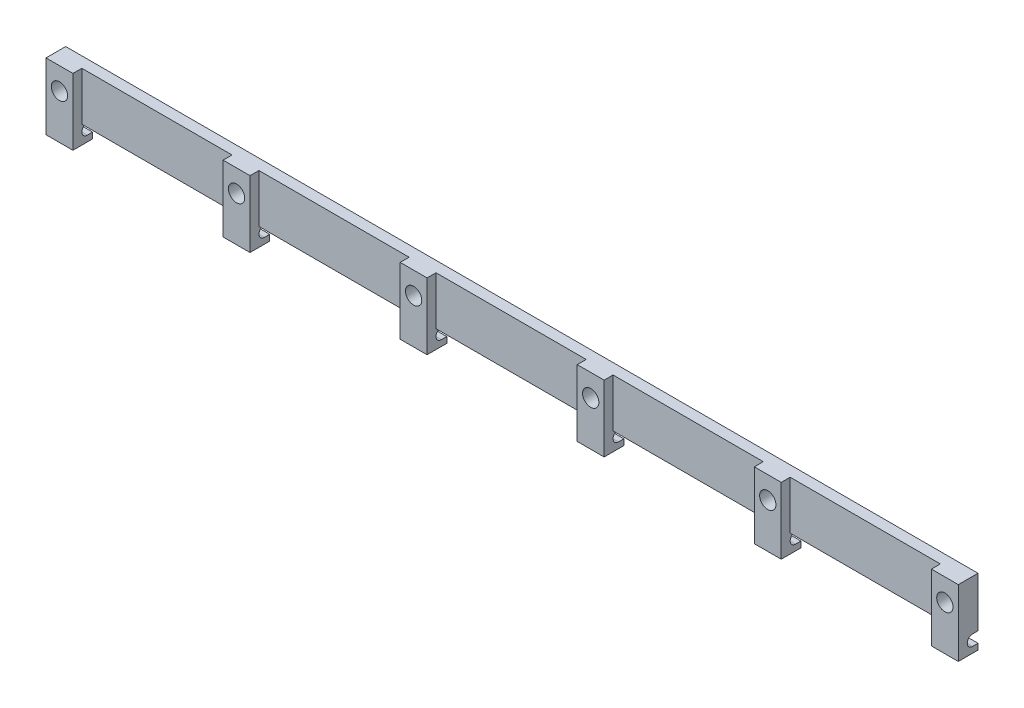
ISO-10303-21;
HEADER;
FILE_DESCRIPTION(('STEP AP214'),'2;1');
FILE_NAME('part.step','',(''),(''),'','','');
FILE_SCHEMA(('AUTOMOTIVE_DESIGN { 1 0 10303 214 1 1 1 1 }'));
ENDSEC;
DATA;
#1=APPLICATION_CONTEXT('core data for automotive mechanical design processes');
#2=APPLICATION_PROTOCOL_DEFINITION('international standard','automotive_design',2000,#1);
#3=PRODUCT_CONTEXT('',#1,'mechanical');
#4=PRODUCT('Part','Part','',(#3));
#5=PRODUCT_RELATED_PRODUCT_CATEGORY('part','',(#4));
#6=PRODUCT_DEFINITION_FORMATION('','',#4);
#7=PRODUCT_DEFINITION_CONTEXT('part definition',#1,'design');
#8=PRODUCT_DEFINITION('design','',#6,#7);
#9=PRODUCT_DEFINITION_SHAPE('','',#8);
#10=(LENGTH_UNIT() NAMED_UNIT(*) SI_UNIT(.MILLI.,.METRE.));
#11=(NAMED_UNIT(*) PLANE_ANGLE_UNIT() SI_UNIT($,.RADIAN.));
#12=(NAMED_UNIT(*) SI_UNIT($,.STERADIAN.) SOLID_ANGLE_UNIT());
#13=UNCERTAINTY_MEASURE_WITH_UNIT(LENGTH_MEASURE(1.E-05),#10,'distance_accuracy_value','');
#14=(GEOMETRIC_REPRESENTATION_CONTEXT(3) GLOBAL_UNCERTAINTY_ASSIGNED_CONTEXT((#13)) GLOBAL_UNIT_ASSIGNED_CONTEXT((#10,
#11,#12)) REPRESENTATION_CONTEXT('',''));
#15=CARTESIAN_POINT('',(0.,0.,0.));
#16=DIRECTION('',(0.,0.,1.));
#17=DIRECTION('',(1.,0.,0.));
#18=AXIS2_PLACEMENT_3D('',#15,#16,#17);
#19=CARTESIAN_POINT('',(0.,0.,0.));
#20=DIRECTION('',(0.,0.,1.));
#21=DIRECTION('',(1.,0.,0.));
#22=AXIS2_PLACEMENT_3D('',#19,#20,#21);
#23=PLANE('',#22);
#24=DIRECTION('',(0.,1.,0.));
#25=VECTOR('',#24,1.);
#26=CARTESIAN_POINT('',(76.962,0.,0.));
#27=LINE('',#26,#25);
#28=CARTESIAN_POINT('',(76.962,-11.938,0.));
#29=VERTEX_POINT('',#28);
#30=CARTESIAN_POINT('',(76.962,-10.8712,0.));
#31=VERTEX_POINT('',#30);
#32=EDGE_CURVE('E551',#29,#31,#27,.T.);
#33=ORIENTED_EDGE('',*,*,#32,.T.);
#34=DIRECTION('',(-1.,0.,0.));
#35=VECTOR('',#34,1.);
#36=CARTESIAN_POINT('',(81.788,-10.8712,0.));
#37=LINE('',#36,#35);
#38=CARTESIAN_POINT('',(81.788,-10.8712,0.));
#39=VERTEX_POINT('',#38);
#40=EDGE_CURVE('E437',#39,#31,#37,.T.);
#41=ORIENTED_EDGE('',*,*,#40,.F.);
#42=DIRECTION('',(0.,1.,0.));
#43=VECTOR('',#42,1.);
#44=CARTESIAN_POINT('',(81.788,0.,0.));
#45=LINE('',#44,#43);
#46=CARTESIAN_POINT('',(81.788,-11.938,0.));
#47=VERTEX_POINT('',#46);
#48=EDGE_CURVE('E798',#47,#39,#45,.T.);
#49=ORIENTED_EDGE('',*,*,#48,.F.);
#50=DIRECTION('',(-1.,0.,0.));
#51=VECTOR('',#50,1.);
#52=CARTESIAN_POINT('',(76.962,-11.938,0.));
#53=LINE('',#52,#51);
#54=EDGE_CURVE('E541',#47,#29,#53,.T.);
#55=ORIENTED_EDGE('',*,*,#54,.T.);
#56=EDGE_LOOP('',(#33,#41,#49,#55));
#57=FACE_BOUND('',#56,.T.);
#58=ADVANCED_FACE('F33',(#57),#23,.F.);
#59=DIRECTION('',(0.,1.,0.));
#60=VECTOR('',#59,1.);
#61=CARTESIAN_POINT('',(45.212,0.,0.));
#62=LINE('',#61,#60);
#63=CARTESIAN_POINT('',(45.212,-11.938,0.));
#64=VERTEX_POINT('',#63);
#65=CARTESIAN_POINT('',(45.212,-10.8712,0.));
#66=VERTEX_POINT('',#65);
#67=EDGE_CURVE('E583',#64,#66,#62,.T.);
#68=ORIENTED_EDGE('',*,*,#67,.T.);
#69=CARTESIAN_POINT('',(50.038,-10.8712,0.));
#70=VERTEX_POINT('',#69);
#71=EDGE_CURVE('E439',#70,#66,#37,.T.);
#72=ORIENTED_EDGE('',*,*,#71,.F.);
#73=DIRECTION('',(0.,-1.,0.));
#74=VECTOR('',#73,1.);
#75=CARTESIAN_POINT('',(50.038,0.,0.));
#76=LINE('',#75,#74);
#77=CARTESIAN_POINT('',(50.038,-11.938,0.));
#78=VERTEX_POINT('',#77);
#79=EDGE_CURVE('E586',#70,#78,#76,.T.);
#80=ORIENTED_EDGE('',*,*,#79,.T.);
#81=DIRECTION('',(-1.,0.,0.));
#82=VECTOR('',#81,1.);
#83=CARTESIAN_POINT('',(45.212,-11.938,0.));
#84=LINE('',#83,#82);
#85=EDGE_CURVE('E573',#78,#64,#84,.T.);
#86=ORIENTED_EDGE('',*,*,#85,.T.);
#87=EDGE_LOOP('',(#68,#72,#80,#86));
#88=FACE_BOUND('',#87,.T.);
#89=ADVANCED_FACE('F911',(#88),#23,.F.);
#90=DIRECTION('',(0.,1.,0.));
#91=VECTOR('',#90,1.);
#92=CARTESIAN_POINT('',(13.462,0.,0.));
#93=LINE('',#92,#91);
#94=CARTESIAN_POINT('',(13.462,-11.938,0.));
#95=VERTEX_POINT('',#94);
#96=CARTESIAN_POINT('',(13.462,-10.8712,0.));
#97=VERTEX_POINT('',#96);
#98=EDGE_CURVE('E617',#95,#97,#93,.T.);
#99=ORIENTED_EDGE('',*,*,#98,.T.);
#100=CARTESIAN_POINT('',(18.288,-10.8712,0.));
#101=VERTEX_POINT('',#100);
#102=EDGE_CURVE('E891',#101,#97,#37,.T.);
#103=ORIENTED_EDGE('',*,*,#102,.F.);
#104=DIRECTION('',(0.,-1.,0.));
#105=VECTOR('',#104,1.);
#106=CARTESIAN_POINT('',(18.288,0.,0.));
#107=LINE('',#106,#105);
#108=CARTESIAN_POINT('',(18.288,-11.938,0.));
#109=VERTEX_POINT('',#108);
#110=EDGE_CURVE('E612',#101,#109,#107,.T.);
#111=ORIENTED_EDGE('',*,*,#110,.T.);
#112=DIRECTION('',(-1.,0.,0.));
#113=VECTOR('',#112,1.);
#114=CARTESIAN_POINT('',(13.462,-11.938,0.));
#115=LINE('',#114,#113);
#116=EDGE_CURVE('E630',#109,#95,#115,.T.);
#117=ORIENTED_EDGE('',*,*,#116,.T.);
#118=EDGE_LOOP('',(#99,#103,#111,#117));
#119=FACE_BOUND('',#118,.T.);
#120=ADVANCED_FACE('F944',(#119),#23,.F.);
#121=DIRECTION('',(0.,1.,0.));
#122=VECTOR('',#121,1.);
#123=CARTESIAN_POINT('',(-18.288,0.,0.));
#124=LINE('',#123,#122);
#125=CARTESIAN_POINT('',(-18.288,-11.938,0.));
#126=VERTEX_POINT('',#125);
#127=CARTESIAN_POINT('',(-18.288,-10.8712,0.));
#128=VERTEX_POINT('',#127);
#129=EDGE_CURVE('E661',#126,#128,#124,.T.);
#130=ORIENTED_EDGE('',*,*,#129,.T.);
#131=CARTESIAN_POINT('',(-13.462,-10.8712,0.));
#132=VERTEX_POINT('',#131);
#133=EDGE_CURVE('E887',#132,#128,#37,.T.);
#134=ORIENTED_EDGE('',*,*,#133,.F.);
#135=DIRECTION('',(0.,-1.,0.));
#136=VECTOR('',#135,1.);
#137=CARTESIAN_POINT('',(-13.462,0.,0.));
#138=LINE('',#137,#136);
#139=CARTESIAN_POINT('',(-13.462,-11.938,0.));
#140=VERTEX_POINT('',#139);
#141=EDGE_CURVE('E656',#132,#140,#138,.T.);
#142=ORIENTED_EDGE('',*,*,#141,.T.);
#143=DIRECTION('',(-1.,0.,0.));
#144=VECTOR('',#143,1.);
#145=CARTESIAN_POINT('',(-13.462,-11.938,0.));
#146=LINE('',#145,#144);
#147=EDGE_CURVE('E674',#140,#126,#146,.T.);
#148=ORIENTED_EDGE('',*,*,#147,.T.);
#149=EDGE_LOOP('',(#130,#134,#142,#148));
#150=FACE_BOUND('',#149,.T.);
#151=ADVANCED_FACE('F946',(#150),#23,.F.);
#152=DIRECTION('',(0.,1.,0.));
#153=VECTOR('',#152,1.);
#154=CARTESIAN_POINT('',(-50.038,0.,0.));
#155=LINE('',#154,#153);
#156=CARTESIAN_POINT('',(-50.038,-11.938,0.));
#157=VERTEX_POINT('',#156);
#158=CARTESIAN_POINT('',(-50.038,-10.8712,0.));
#159=VERTEX_POINT('',#158);
#160=EDGE_CURVE('E706',#157,#159,#155,.T.);
#161=ORIENTED_EDGE('',*,*,#160,.T.);
#162=CARTESIAN_POINT('',(-45.212,-10.8712,0.));
#163=VERTEX_POINT('',#162);
#164=EDGE_CURVE('E886',#163,#159,#37,.T.);
#165=ORIENTED_EDGE('',*,*,#164,.F.);
#166=DIRECTION('',(0.,-1.,0.));
#167=VECTOR('',#166,1.);
#168=CARTESIAN_POINT('',(-45.212,0.,0.));
#169=LINE('',#168,#167);
#170=CARTESIAN_POINT('',(-45.212,-11.938,0.));
#171=VERTEX_POINT('',#170);
#172=EDGE_CURVE('E701',#163,#171,#169,.T.);
#173=ORIENTED_EDGE('',*,*,#172,.T.);
#174=DIRECTION('',(-1.,0.,0.));
#175=VECTOR('',#174,1.);
#176=CARTESIAN_POINT('',(-45.212,-11.938,0.));
#177=LINE('',#176,#175);
#178=EDGE_CURVE('E719',#171,#157,#177,.T.);
#179=ORIENTED_EDGE('',*,*,#178,.T.);
#180=EDGE_LOOP('',(#161,#165,#173,#179));
#181=FACE_BOUND('',#180,.T.);
#182=ADVANCED_FACE('F952',(#181),#23,.F.);
#183=DIRECTION('',(0.,-1.,0.));
#184=VECTOR('',#183,1.);
#185=CARTESIAN_POINT('',(-81.788,0.,0.));
#186=LINE('',#185,#184);
#187=CARTESIAN_POINT('',(-81.788,-10.8712,0.));
#188=VERTEX_POINT('',#187);
#189=CARTESIAN_POINT('',(-81.788,-11.938,0.));
#190=VERTEX_POINT('',#189);
#191=EDGE_CURVE('E779',#188,#190,#186,.T.);
#192=ORIENTED_EDGE('',*,*,#191,.F.);
#193=CARTESIAN_POINT('',(-76.962,-10.8712,0.));
#194=VERTEX_POINT('',#193);
#195=EDGE_CURVE('E440',#194,#188,#37,.T.);
#196=ORIENTED_EDGE('',*,*,#195,.F.);
#197=DIRECTION('',(0.,-1.,0.));
#198=VECTOR('',#197,1.);
#199=CARTESIAN_POINT('',(-76.962,0.,0.));
#200=LINE('',#199,#198);
#201=CARTESIAN_POINT('',(-76.962,-11.938,0.));
#202=VERTEX_POINT('',#201);
#203=EDGE_CURVE('E746',#194,#202,#200,.T.);
#204=ORIENTED_EDGE('',*,*,#203,.T.);
#205=DIRECTION('',(-1.,0.,0.));
#206=VECTOR('',#205,1.);
#207=CARTESIAN_POINT('',(-76.962,-11.938,0.));
#208=LINE('',#207,#206);
#209=EDGE_CURVE('E751',#202,#190,#208,.T.);
#210=ORIENTED_EDGE('',*,*,#209,.T.);
#211=EDGE_LOOP('',(#192,#196,#204,#210));
#212=FACE_BOUND('',#211,.T.);
#213=ADVANCED_FACE('F883',(#212),#23,.F.);
#214=CARTESIAN_POINT('',(-81.788,-8.6868,1.9304));
#215=DIRECTION('',(0.,1.,0.));
#216=DIRECTION('',(0.,0.,1.));
#217=AXIS2_PLACEMENT_3D('',#214,#215,#216);
#218=PLANE('',#217);
#219=DIRECTION('',(1.,0.,0.));
#220=VECTOR('',#219,1.);
#221=CARTESIAN_POINT('',(-81.788,-8.6868,0.));
#222=LINE('',#221,#220);
#223=CARTESIAN_POINT('',(18.288,-8.6868,0.));
#224=VERTEX_POINT('',#223);
#225=CARTESIAN_POINT('',(45.212,-8.6868,0.));
#226=VERTEX_POINT('',#225);
#227=EDGE_CURVE('E1379',#224,#226,#222,.T.);
#228=ORIENTED_EDGE('',*,*,#227,.T.);
#229=DIRECTION('',(0.,0.,1.));
#230=VECTOR('',#229,1.);
#231=CARTESIAN_POINT('',(45.212,-8.6868,1.9304));
#232=LINE('',#231,#230);
#233=CARTESIAN_POINT('',(45.212,-8.6868,1.9304));
#234=VERTEX_POINT('',#233);
#235=EDGE_CURVE('E610',#226,#234,#232,.T.);
#236=ORIENTED_EDGE('',*,*,#235,.T.);
#237=DIRECTION('',(1.,0.,0.));
#238=VECTOR('',#237,1.);
#239=CARTESIAN_POINT('',(-81.788,-8.6868,1.9304));
#240=LINE('',#239,#238);
#241=CARTESIAN_POINT('',(18.288,-8.6868,1.9304));
#242=VERTEX_POINT('',#241);
#243=EDGE_CURVE('E829',#242,#234,#240,.T.);
#244=ORIENTED_EDGE('',*,*,#243,.F.);
#245=DIRECTION('',(0.,0.,-1.));
#246=VECTOR('',#245,1.);
#247=CARTESIAN_POINT('',(18.288,-8.6868,1.9304));
#248=LINE('',#247,#246);
#249=EDGE_CURVE('E649',#242,#224,#248,.T.);
#250=ORIENTED_EDGE('',*,*,#249,.T.);
#251=EDGE_LOOP('',(#228,#236,#244,#250));
#252=FACE_BOUND('',#251,.T.);
#253=ADVANCED_FACE('F970',(#252),#218,.F.);
#254=CARTESIAN_POINT('',(0.,0.,1.9304));
#255=DIRECTION('',(0.,0.,1.));
#256=DIRECTION('',(1.,0.,0.));
#257=AXIS2_PLACEMENT_3D('',#254,#255,#256);
#258=PLANE('',#257);
#259=DIRECTION('',(0.,-1.,0.));
#260=VECTOR('',#259,1.);
#261=CARTESIAN_POINT('',(45.212,0.,1.9304));
#262=LINE('',#261,#260);
#263=CARTESIAN_POINT('',(45.212,0.,1.9304));
#264=VERTEX_POINT('',#263);
#265=EDGE_CURVE('E607',#264,#234,#262,.T.);
#266=ORIENTED_EDGE('',*,*,#265,.F.);
#267=DIRECTION('',(-1.,0.,0.));
#268=VECTOR('',#267,1.);
#269=CARTESIAN_POINT('',(-81.788,0.,1.9304));
#270=LINE('',#269,#268);
#271=CARTESIAN_POINT('',(18.288,0.,1.9304));
#272=VERTEX_POINT('',#271);
#273=EDGE_CURVE('E788',#264,#272,#270,.T.);
#274=ORIENTED_EDGE('',*,*,#273,.T.);
#275=DIRECTION('',(0.,1.,0.));
#276=VECTOR('',#275,1.);
#277=CARTESIAN_POINT('',(18.288,0.,1.9304));
#278=LINE('',#277,#276);
#279=EDGE_CURVE('E639',#242,#272,#278,.T.);
#280=ORIENTED_EDGE('',*,*,#279,.F.);
#281=ORIENTED_EDGE('',*,*,#243,.T.);
#282=EDGE_LOOP('',(#266,#274,#280,#281));
#283=FACE_BOUND('',#282,.T.);
#284=ADVANCED_FACE('F923',(#283),#258,.T.);
#285=CARTESIAN_POINT('',(-13.462,-8.6868,0.));
#286=VERTEX_POINT('',#285);
#287=CARTESIAN_POINT('',(13.462,-8.6868,0.));
#288=VERTEX_POINT('',#287);
#289=EDGE_CURVE('E1045',#286,#288,#222,.T.);
#290=ORIENTED_EDGE('',*,*,#289,.T.);
#291=DIRECTION('',(0.,0.,1.));
#292=VECTOR('',#291,1.);
#293=CARTESIAN_POINT('',(13.462,-8.6868,1.9304));
#294=LINE('',#293,#292);
#295=CARTESIAN_POINT('',(13.462,-8.6868,1.9304));
#296=VERTEX_POINT('',#295);
#297=EDGE_CURVE('E654',#288,#296,#294,.T.);
#298=ORIENTED_EDGE('',*,*,#297,.T.);
#299=CARTESIAN_POINT('',(-13.462,-8.6868,1.9304));
#300=VERTEX_POINT('',#299);
#301=EDGE_CURVE('E831',#300,#296,#240,.T.);
#302=ORIENTED_EDGE('',*,*,#301,.F.);
#303=DIRECTION('',(0.,0.,-1.));
#304=VECTOR('',#303,1.);
#305=CARTESIAN_POINT('',(-13.462,-8.6868,1.9304));
#306=LINE('',#305,#304);
#307=EDGE_CURVE('E699',#300,#286,#306,.T.);
#308=ORIENTED_EDGE('',*,*,#307,.T.);
#309=EDGE_LOOP('',(#290,#298,#302,#308));
#310=FACE_BOUND('',#309,.T.);
#311=ADVANCED_FACE('F976',(#310),#218,.F.);
#312=DIRECTION('',(0.,-1.,0.));
#313=VECTOR('',#312,1.);
#314=CARTESIAN_POINT('',(13.462,0.,1.9304));
#315=LINE('',#314,#313);
#316=CARTESIAN_POINT('',(13.462,0.,1.9304));
#317=VERTEX_POINT('',#316);
#318=EDGE_CURVE('E651',#317,#296,#315,.T.);
#319=ORIENTED_EDGE('',*,*,#318,.F.);
#320=CARTESIAN_POINT('',(-13.462,0.,1.9304));
#321=VERTEX_POINT('',#320);
#322=EDGE_CURVE('E857',#317,#321,#270,.T.);
#323=ORIENTED_EDGE('',*,*,#322,.T.);
#324=DIRECTION('',(0.,1.,0.));
#325=VECTOR('',#324,1.);
#326=CARTESIAN_POINT('',(-13.462,0.,1.9304));
#327=LINE('',#326,#325);
#328=EDGE_CURVE('E696',#300,#321,#327,.T.);
#329=ORIENTED_EDGE('',*,*,#328,.F.);
#330=ORIENTED_EDGE('',*,*,#301,.T.);
#331=EDGE_LOOP('',(#319,#323,#329,#330));
#332=FACE_BOUND('',#331,.T.);
#333=ADVANCED_FACE('F1373',(#332),#258,.T.);
#334=CARTESIAN_POINT('',(50.038,-8.6868,0.));
#335=VERTEX_POINT('',#334);
#336=CARTESIAN_POINT('',(76.962,-8.6868,0.));
#337=VERTEX_POINT('',#336);
#338=EDGE_CURVE('E792',#335,#337,#222,.T.);
#339=ORIENTED_EDGE('',*,*,#338,.T.);
#340=DIRECTION('',(0.,0.,1.));
#341=VECTOR('',#340,1.);
#342=CARTESIAN_POINT('',(76.962,-8.6868,1.9304));
#343=LINE('',#342,#341);
#344=CARTESIAN_POINT('',(76.962,-8.6868,1.9304));
#345=VERTEX_POINT('',#344);
#346=EDGE_CURVE('E566',#337,#345,#343,.T.);
#347=ORIENTED_EDGE('',*,*,#346,.T.);
#348=CARTESIAN_POINT('',(50.038,-8.6868,1.9304));
#349=VERTEX_POINT('',#348);
#350=EDGE_CURVE('E784',#349,#345,#240,.T.);
#351=ORIENTED_EDGE('',*,*,#350,.F.);
#352=DIRECTION('',(0.,0.,-1.));
#353=VECTOR('',#352,1.);
#354=CARTESIAN_POINT('',(50.038,-8.6868,1.9304));
#355=LINE('',#354,#353);
#356=EDGE_CURVE('E605',#349,#335,#355,.T.);
#357=ORIENTED_EDGE('',*,*,#356,.T.);
#358=EDGE_LOOP('',(#339,#347,#351,#357));
#359=FACE_BOUND('',#358,.T.);
#360=ADVANCED_FACE('F825',(#359),#218,.F.);
#361=DIRECTION('',(0.,-1.,0.));
#362=VECTOR('',#361,1.);
#363=CARTESIAN_POINT('',(76.962,0.,1.9304));
#364=LINE('',#363,#362);
#365=CARTESIAN_POINT('',(76.962,0.,1.9304));
#366=VERTEX_POINT('',#365);
#367=EDGE_CURVE('E558',#366,#345,#364,.T.);
#368=ORIENTED_EDGE('',*,*,#367,.F.);
#369=CARTESIAN_POINT('',(50.038,0.,1.9304));
#370=VERTEX_POINT('',#369);
#371=EDGE_CURVE('E785',#366,#370,#270,.T.);
#372=ORIENTED_EDGE('',*,*,#371,.T.);
#373=DIRECTION('',(0.,1.,0.));
#374=VECTOR('',#373,1.);
#375=CARTESIAN_POINT('',(50.038,0.,1.9304));
#376=LINE('',#375,#374);
#377=EDGE_CURVE('E594',#349,#370,#376,.T.);
#378=ORIENTED_EDGE('',*,*,#377,.F.);
#379=ORIENTED_EDGE('',*,*,#350,.T.);
#380=EDGE_LOOP('',(#368,#372,#378,#379));
#381=FACE_BOUND('',#380,.T.);
#382=ADVANCED_FACE('F828',(#381),#258,.T.);
#383=CARTESIAN_POINT('',(-45.212,-8.6868,0.));
#384=VERTEX_POINT('',#383);
#385=CARTESIAN_POINT('',(-18.288,-8.6868,0.));
#386=VERTEX_POINT('',#385);
#387=EDGE_CURVE('E797',#384,#386,#222,.T.);
#388=ORIENTED_EDGE('',*,*,#387,.T.);
#389=DIRECTION('',(0.,0.,1.));
#390=VECTOR('',#389,1.);
#391=CARTESIAN_POINT('',(-18.288,-8.6868,1.9304));
#392=LINE('',#391,#390);
#393=CARTESIAN_POINT('',(-18.288,-8.6868,1.9304));
#394=VERTEX_POINT('',#393);
#395=EDGE_CURVE('E693',#386,#394,#392,.T.);
#396=ORIENTED_EDGE('',*,*,#395,.T.);
#397=CARTESIAN_POINT('',(-45.212,-8.6868,1.9304));
#398=VERTEX_POINT('',#397);
#399=EDGE_CURVE('E783',#398,#394,#240,.T.);
#400=ORIENTED_EDGE('',*,*,#399,.F.);
#401=DIRECTION('',(0.,0.,-1.));
#402=VECTOR('',#401,1.);
#403=CARTESIAN_POINT('',(-45.212,-8.6868,1.9304));
#404=LINE('',#403,#402);
#405=EDGE_CURVE('E744',#398,#384,#404,.T.);
#406=ORIENTED_EDGE('',*,*,#405,.T.);
#407=EDGE_LOOP('',(#388,#396,#400,#406));
#408=FACE_BOUND('',#407,.T.);
#409=ADVANCED_FACE('F846',(#408),#218,.F.);
#410=DIRECTION('',(0.,-1.,0.));
#411=VECTOR('',#410,1.);
#412=CARTESIAN_POINT('',(-18.288,0.,1.9304));
#413=LINE('',#412,#411);
#414=CARTESIAN_POINT('',(-18.288,0.,1.9304));
#415=VERTEX_POINT('',#414);
#416=EDGE_CURVE('E683',#415,#394,#413,.T.);
#417=ORIENTED_EDGE('',*,*,#416,.F.);
#418=CARTESIAN_POINT('',(-45.212,0.,1.9304));
#419=VERTEX_POINT('',#418);
#420=EDGE_CURVE('E856',#415,#419,#270,.T.);
#421=ORIENTED_EDGE('',*,*,#420,.T.);
#422=DIRECTION('',(0.,1.,0.));
#423=VECTOR('',#422,1.);
#424=CARTESIAN_POINT('',(-45.212,0.,1.9304));
#425=LINE('',#424,#423);
#426=EDGE_CURVE('E741',#398,#419,#425,.T.);
#427=ORIENTED_EDGE('',*,*,#426,.F.);
#428=ORIENTED_EDGE('',*,*,#399,.T.);
#429=EDGE_LOOP('',(#417,#421,#427,#428));
#430=FACE_BOUND('',#429,.T.);
#431=ADVANCED_FACE('F840',(#430),#258,.T.);
#432=CARTESIAN_POINT('',(-81.788,0.,1.9304));
#433=DIRECTION('',(1.,0.,0.));
#434=DIRECTION('',(0.,0.,-1.));
#435=AXIS2_PLACEMENT_3D('',#432,#433,#434);
#436=PLANE('',#435);
#437=CARTESIAN_POINT('',(-81.788,-9.906,0.965200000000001));
#438=DIRECTION('',(-1.,0.,0.));
#439=DIRECTION('',(0.,0.,1.));
#440=AXIS2_PLACEMENT_3D('',#437,#438,#439);
#441=CIRCLE('',#440,0.965199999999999);
#442=CARTESIAN_POINT('',(-81.788,-10.8712,0.965200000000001));
#443=VERTEX_POINT('',#442);
#444=CARTESIAN_POINT('',(-81.788,-8.9408,0.965200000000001));
#445=VERTEX_POINT('',#444);
#446=EDGE_CURVE('E428',#443,#445,#441,.T.);
#447=ORIENTED_EDGE('',*,*,#446,.F.);
#448=DIRECTION('',(0.,0.,1.));
#449=VECTOR('',#448,1.);
#450=CARTESIAN_POINT('',(-81.788,-10.8712,0.965200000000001));
#451=LINE('',#450,#449);
#452=EDGE_CURVE('E421',#188,#443,#451,.T.);
#453=ORIENTED_EDGE('',*,*,#452,.F.);
#454=ORIENTED_EDGE('',*,*,#191,.T.);
#455=DIRECTION('',(0.,0.,-1.));
#456=VECTOR('',#455,1.);
#457=CARTESIAN_POINT('',(-81.788,-11.938,3.5306));
#458=LINE('',#457,#456);
#459=CARTESIAN_POINT('',(-81.788,-11.938,3.5306));
#460=VERTEX_POINT('',#459);
#461=EDGE_CURVE('E766',#460,#190,#458,.T.);
#462=ORIENTED_EDGE('',*,*,#461,.F.);
#463=DIRECTION('',(0.,1.,0.));
#464=VECTOR('',#463,1.);
#465=CARTESIAN_POINT('',(-81.788,0.,3.5306));
#466=LINE('',#465,#464);
#467=CARTESIAN_POINT('',(-81.788,0.,3.5306));
#468=VERTEX_POINT('',#467);
#469=EDGE_CURVE('E757',#460,#468,#466,.T.);
#470=ORIENTED_EDGE('',*,*,#469,.T.);
#471=DIRECTION('',(0.,0.,-1.));
#472=VECTOR('',#471,1.);
#473=CARTESIAN_POINT('',(-81.788,0.,1.9304));
#474=LINE('',#473,#472);
#475=CARTESIAN_POINT('',(-81.788,0.,0.));
#476=VERTEX_POINT('',#475);
#477=EDGE_CURVE('E787',#468,#476,#474,.T.);
#478=ORIENTED_EDGE('',*,*,#477,.T.);
#479=CARTESIAN_POINT('',(-81.788,-8.9408,0.));
#480=VERTEX_POINT('',#479);
#481=EDGE_CURVE('E789',#476,#480,#186,.T.);
#482=ORIENTED_EDGE('',*,*,#481,.T.);
#483=DIRECTION('',(0.,0.,-1.));
#484=VECTOR('',#483,1.);
#485=CARTESIAN_POINT('',(-81.788,-8.9408,0.965200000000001));
#486=LINE('',#485,#484);
#487=EDGE_CURVE('E424',#445,#480,#486,.T.);
#488=ORIENTED_EDGE('',*,*,#487,.F.);
#489=EDGE_LOOP('',(#447,#453,#454,#462,#470,#478,#482,#488));
#490=FACE_BOUND('',#489,.T.);
#491=ADVANCED_FACE('F35',(#490),#436,.F.);
#492=CARTESIAN_POINT('',(-76.962,-8.6868,0.));
#493=VERTEX_POINT('',#492);
#494=CARTESIAN_POINT('',(-50.038,-8.6868,0.));
#495=VERTEX_POINT('',#494);
#496=EDGE_CURVE('E793',#493,#495,#222,.T.);
#497=ORIENTED_EDGE('',*,*,#496,.T.);
#498=DIRECTION('',(0.,0.,1.));
#499=VECTOR('',#498,1.);
#500=CARTESIAN_POINT('',(-50.038,-8.6868,1.9304));
#501=LINE('',#500,#499);
#502=CARTESIAN_POINT('',(-50.038,-8.6868,1.9304));
#503=VERTEX_POINT('',#502);
#504=EDGE_CURVE('E738',#495,#503,#501,.T.);
#505=ORIENTED_EDGE('',*,*,#504,.T.);
#506=CARTESIAN_POINT('',(-76.962,-8.6868,1.9304));
#507=VERTEX_POINT('',#506);
#508=EDGE_CURVE('E780',#507,#503,#240,.T.);
#509=ORIENTED_EDGE('',*,*,#508,.F.);
#510=DIRECTION('',(0.,0.,-1.));
#511=VECTOR('',#510,1.);
#512=CARTESIAN_POINT('',(-76.962,-8.6868,1.9304));
#513=LINE('',#512,#511);
#514=EDGE_CURVE('E777',#507,#493,#513,.T.);
#515=ORIENTED_EDGE('',*,*,#514,.T.);
#516=EDGE_LOOP('',(#497,#505,#509,#515));
#517=FACE_BOUND('',#516,.T.);
#518=ADVANCED_FACE('F977',(#517),#218,.F.);
#519=CARTESIAN_POINT('',(81.788,0.,1.9304));
#520=DIRECTION('',(-1.,0.,0.));
#521=DIRECTION('',(0.,0.,1.));
#522=AXIS2_PLACEMENT_3D('',#519,#520,#521);
#523=PLANE('',#522);
#524=ORIENTED_EDGE('',*,*,#48,.T.);
#525=DIRECTION('',(0.,0.,1.));
#526=VECTOR('',#525,1.);
#527=CARTESIAN_POINT('',(81.788,-10.8712,0.965200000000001));
#528=LINE('',#527,#526);
#529=CARTESIAN_POINT('',(81.788,-10.8712,0.965200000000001));
#530=VERTEX_POINT('',#529);
#531=EDGE_CURVE('E417',#39,#530,#528,.T.);
#532=ORIENTED_EDGE('',*,*,#531,.T.);
#533=CARTESIAN_POINT('',(81.788,-9.906,0.965200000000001));
#534=DIRECTION('',(-1.,0.,0.));
#535=DIRECTION('',(0.,0.,1.));
#536=AXIS2_PLACEMENT_3D('',#533,#534,#535);
#537=CIRCLE('',#536,0.965199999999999);
#538=CARTESIAN_POINT('',(81.788,-8.9408,0.965200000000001));
#539=VERTEX_POINT('',#538);
#540=EDGE_CURVE('E402',#530,#539,#537,.T.);
#541=ORIENTED_EDGE('',*,*,#540,.T.);
#542=DIRECTION('',(0.,0.,-1.));
#543=VECTOR('',#542,1.);
#544=CARTESIAN_POINT('',(81.788,-8.9408,0.965200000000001));
#545=LINE('',#544,#543);
#546=CARTESIAN_POINT('',(81.788,-8.9408,0.));
#547=VERTEX_POINT('',#546);
#548=EDGE_CURVE('E411',#539,#547,#545,.T.);
#549=ORIENTED_EDGE('',*,*,#548,.T.);
#550=CARTESIAN_POINT('',(81.788,0.,0.));
#551=VERTEX_POINT('',#550);
#552=EDGE_CURVE('E796',#547,#551,#45,.T.);
#553=ORIENTED_EDGE('',*,*,#552,.T.);
#554=DIRECTION('',(0.,0.,-1.));
#555=VECTOR('',#554,1.);
#556=CARTESIAN_POINT('',(81.788,0.,1.9304));
#557=LINE('',#556,#555);
#558=CARTESIAN_POINT('',(81.788,0.,3.5306));
#559=VERTEX_POINT('',#558);
#560=EDGE_CURVE('E804',#559,#551,#557,.T.);
#561=ORIENTED_EDGE('',*,*,#560,.F.);
#562=DIRECTION('',(0.,-1.,0.));
#563=VECTOR('',#562,1.);
#564=CARTESIAN_POINT('',(81.788,0.,3.5306));
#565=LINE('',#564,#563);
#566=CARTESIAN_POINT('',(81.788,-11.938,3.5306));
#567=VERTEX_POINT('',#566);
#568=EDGE_CURVE('E544',#559,#567,#565,.T.);
#569=ORIENTED_EDGE('',*,*,#568,.T.);
#570=DIRECTION('',(0.,0.,-1.));
#571=VECTOR('',#570,1.);
#572=CARTESIAN_POINT('',(81.788,-11.938,3.5306));
#573=LINE('',#572,#571);
#574=EDGE_CURVE('E559',#567,#47,#573,.T.);
#575=ORIENTED_EDGE('',*,*,#574,.T.);
#576=EDGE_LOOP('',(#524,#532,#541,#549,#553,#561,#569,#575));
#577=FACE_BOUND('',#576,.T.);
#578=ADVANCED_FACE('F420',(#577),#523,.F.);
#579=CARTESIAN_POINT('',(-81.788,0.,1.9304));
#580=DIRECTION('',(0.,-1.,0.));
#581=DIRECTION('',(0.,0.,-1.));
#582=AXIS2_PLACEMENT_3D('',#579,#580,#581);
#583=PLANE('',#582);
#584=ORIENTED_EDGE('',*,*,#371,.F.);
#585=DIRECTION('',(0.,0.,-1.));
#586=VECTOR('',#585,1.);
#587=CARTESIAN_POINT('',(76.962,0.,3.5306));
#588=LINE('',#587,#586);
#589=CARTESIAN_POINT('',(76.962,0.,3.5306));
#590=VERTEX_POINT('',#589);
#591=EDGE_CURVE('E550',#590,#366,#588,.T.);
#592=ORIENTED_EDGE('',*,*,#591,.F.);
#593=DIRECTION('',(1.,0.,0.));
#594=VECTOR('',#593,1.);
#595=CARTESIAN_POINT('',(76.962,0.,3.5306));
#596=LINE('',#595,#594);
#597=EDGE_CURVE('E540',#590,#559,#596,.T.);
#598=ORIENTED_EDGE('',*,*,#597,.T.);
#599=ORIENTED_EDGE('',*,*,#560,.T.);
#600=DIRECTION('',(-1.,0.,0.));
#601=VECTOR('',#600,1.);
#602=CARTESIAN_POINT('',(-81.788,0.,0.));
#603=LINE('',#602,#601);
#604=EDGE_CURVE('E800',#551,#476,#603,.T.);
#605=ORIENTED_EDGE('',*,*,#604,.T.);
#606=ORIENTED_EDGE('',*,*,#477,.F.);
#607=DIRECTION('',(1.,0.,0.));
#608=VECTOR('',#607,1.);
#609=CARTESIAN_POINT('',(-76.962,0.,3.5306));
#610=LINE('',#609,#608);
#611=CARTESIAN_POINT('',(-76.962,0.,3.5306));
#612=VERTEX_POINT('',#611);
#613=EDGE_CURVE('E747',#468,#612,#610,.T.);
#614=ORIENTED_EDGE('',*,*,#613,.T.);
#615=DIRECTION('',(0.,0.,-1.));
#616=VECTOR('',#615,1.);
#617=CARTESIAN_POINT('',(-76.962,0.,3.5306));
#618=LINE('',#617,#616);
#619=CARTESIAN_POINT('',(-76.962,0.,1.9304));
#620=VERTEX_POINT('',#619);
#621=EDGE_CURVE('E760',#612,#620,#618,.T.);
#622=ORIENTED_EDGE('',*,*,#621,.T.);
#623=CARTESIAN_POINT('',(-50.038,0.,1.9304));
#624=VERTEX_POINT('',#623);
#625=EDGE_CURVE('E782',#624,#620,#270,.T.);
#626=ORIENTED_EDGE('',*,*,#625,.F.);
#627=DIRECTION('',(0.,0.,-1.));
#628=VECTOR('',#627,1.);
#629=CARTESIAN_POINT('',(-50.038,0.,3.5306));
#630=LINE('',#629,#628);
#631=CARTESIAN_POINT('',(-50.038,0.,3.5306));
#632=VERTEX_POINT('',#631);
#633=EDGE_CURVE('E729',#632,#624,#630,.T.);
#634=ORIENTED_EDGE('',*,*,#633,.F.);
#635=DIRECTION('',(1.,0.,0.));
#636=VECTOR('',#635,1.);
#637=CARTESIAN_POINT('',(-45.212,0.,3.5306));
#638=LINE('',#637,#636);
#639=CARTESIAN_POINT('',(-45.212,0.,3.5306));
#640=VERTEX_POINT('',#639);
#641=EDGE_CURVE('E712',#632,#640,#638,.T.);
#642=ORIENTED_EDGE('',*,*,#641,.T.);
#643=DIRECTION('',(0.,0.,-1.));
#644=VECTOR('',#643,1.);
#645=CARTESIAN_POINT('',(-45.212,0.,3.5306));
#646=LINE('',#645,#644);
#647=EDGE_CURVE('E725',#640,#419,#646,.T.);
#648=ORIENTED_EDGE('',*,*,#647,.T.);
#649=ORIENTED_EDGE('',*,*,#420,.F.);
#650=DIRECTION('',(0.,0.,-1.));
#651=VECTOR('',#650,1.);
#652=CARTESIAN_POINT('',(-18.288,0.,3.5306));
#653=LINE('',#652,#651);
#654=CARTESIAN_POINT('',(-18.288,0.,3.5306));
#655=VERTEX_POINT('',#654);
#656=EDGE_CURVE('E684',#655,#415,#653,.T.);
#657=ORIENTED_EDGE('',*,*,#656,.F.);
#658=DIRECTION('',(1.,0.,0.));
#659=VECTOR('',#658,1.);
#660=CARTESIAN_POINT('',(-13.462,0.,3.5306));
#661=LINE('',#660,#659);
#662=CARTESIAN_POINT('',(-13.462,0.,3.5306));
#663=VERTEX_POINT('',#662);
#664=EDGE_CURVE('E667',#655,#663,#661,.T.);
#665=ORIENTED_EDGE('',*,*,#664,.T.);
#666=DIRECTION('',(0.,0.,-1.));
#667=VECTOR('',#666,1.);
#668=CARTESIAN_POINT('',(-13.462,0.,3.5306));
#669=LINE('',#668,#667);
#670=EDGE_CURVE('E680',#663,#321,#669,.T.);
#671=ORIENTED_EDGE('',*,*,#670,.T.);
#672=ORIENTED_EDGE('',*,*,#322,.F.);
#673=DIRECTION('',(0.,0.,-1.));
#674=VECTOR('',#673,1.);
#675=CARTESIAN_POINT('',(13.462,0.,3.5306));
#676=LINE('',#675,#674);
#677=CARTESIAN_POINT('',(13.462,0.,3.5306));
#678=VERTEX_POINT('',#677);
#679=EDGE_CURVE('E636',#678,#317,#676,.T.);
#680=ORIENTED_EDGE('',*,*,#679,.F.);
#681=DIRECTION('',(1.,0.,0.));
#682=VECTOR('',#681,1.);
#683=CARTESIAN_POINT('',(13.462,0.,3.5306));
#684=LINE('',#683,#682);
#685=CARTESIAN_POINT('',(18.288,0.,3.5306));
#686=VERTEX_POINT('',#685);
#687=EDGE_CURVE('E613',#678,#686,#684,.T.);
#688=ORIENTED_EDGE('',*,*,#687,.T.);
#689=DIRECTION('',(0.,0.,-1.));
#690=VECTOR('',#689,1.);
#691=CARTESIAN_POINT('',(18.288,0.,3.5306));
#692=LINE('',#691,#690);
#693=EDGE_CURVE('E626',#686,#272,#692,.T.);
#694=ORIENTED_EDGE('',*,*,#693,.T.);
#695=ORIENTED_EDGE('',*,*,#273,.F.);
#696=DIRECTION('',(0.,0.,-1.));
#697=VECTOR('',#696,1.);
#698=CARTESIAN_POINT('',(45.212,0.,3.5306));
#699=LINE('',#698,#697);
#700=CARTESIAN_POINT('',(45.212,0.,3.5306));
#701=VERTEX_POINT('',#700);
#702=EDGE_CURVE('E582',#701,#264,#699,.T.);
#703=ORIENTED_EDGE('',*,*,#702,.F.);
#704=DIRECTION('',(1.,0.,0.));
#705=VECTOR('',#704,1.);
#706=CARTESIAN_POINT('',(45.212,0.,3.5306));
#707=LINE('',#706,#705);
#708=CARTESIAN_POINT('',(50.038,0.,3.5306));
#709=VERTEX_POINT('',#708);
#710=EDGE_CURVE('E572',#701,#709,#707,.T.);
#711=ORIENTED_EDGE('',*,*,#710,.T.);
#712=DIRECTION('',(0.,0.,-1.));
#713=VECTOR('',#712,1.);
#714=CARTESIAN_POINT('',(50.038,0.,3.5306));
#715=LINE('',#714,#713);
#716=EDGE_CURVE('E598',#709,#370,#715,.T.);
#717=ORIENTED_EDGE('',*,*,#716,.T.);
#718=EDGE_LOOP('',(#584,#592,#598,#599,#605,#606,#614,#622,#626,#634,#642,#648,#649,#657,#665,
#671,#672,#680,#688,#694,#695,#703,#711,#717));
#719=FACE_BOUND('',#718,.T.);
#720=ADVANCED_FACE('F855',(#719),#583,.F.);
#721=DIRECTION('',(0.,-1.,0.));
#722=VECTOR('',#721,1.);
#723=CARTESIAN_POINT('',(-50.038,0.,1.9304));
#724=LINE('',#723,#722);
#725=EDGE_CURVE('E728',#624,#503,#724,.T.);
#726=ORIENTED_EDGE('',*,*,#725,.F.);
#727=ORIENTED_EDGE('',*,*,#625,.T.);
#728=DIRECTION('',(0.,1.,0.));
#729=VECTOR('',#728,1.);
#730=CARTESIAN_POINT('',(-76.962,0.,1.9304));
#731=LINE('',#730,#729);
#732=EDGE_CURVE('E769',#507,#620,#731,.T.);
#733=ORIENTED_EDGE('',*,*,#732,.F.);
#734=ORIENTED_EDGE('',*,*,#508,.T.);
#735=EDGE_LOOP('',(#726,#727,#733,#734));
#736=FACE_BOUND('',#735,.T.);
#737=ADVANCED_FACE('F860',(#736),#258,.T.);
#738=CARTESIAN_POINT('',(-63.5635,-3.9624,0.));
#739=DIRECTION('',(0.,0.,1.));
#740=DIRECTION('',(1.,0.,0.));
#741=AXIS2_PLACEMENT_3D('',#738,#739,#740);
#742=CIRCLE('',#741,2.12089999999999);
#743=CARTESIAN_POINT('',(-61.4426,-3.9624,0.));
#744=VERTEX_POINT('',#743);
#745=EDGE_CURVE('E807',#744,#744,#742,.F.);
#746=ORIENTED_EDGE('',*,*,#745,.F.);
#747=EDGE_LOOP('',(#746));
#748=FACE_BOUND('',#747,.T.);
#749=CARTESIAN_POINT('',(79.375,-3.96239999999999,0.));
#750=DIRECTION('',(0.,0.,1.));
#751=DIRECTION('',(1.,0.,0.));
#752=AXIS2_PLACEMENT_3D('',#749,#750,#751);
#753=CIRCLE('',#752,1.4605);
#754=CARTESIAN_POINT('',(80.8355,-3.96239999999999,0.));
#755=VERTEX_POINT('',#754);
#756=EDGE_CURVE('E501',#755,#755,#753,.T.);
#757=ORIENTED_EDGE('',*,*,#756,.T.);
#758=EDGE_LOOP('',(#757));
#759=FACE_BOUND('',#758,.T.);
#760=CARTESIAN_POINT('',(47.625,-3.9624,0.));
#761=DIRECTION('',(0.,0.,1.));
#762=DIRECTION('',(1.,0.,0.));
#763=AXIS2_PLACEMENT_3D('',#760,#761,#762);
#764=CIRCLE('',#763,1.4605);
#765=CARTESIAN_POINT('',(49.0855,-3.9624,0.));
#766=VERTEX_POINT('',#765);
#767=EDGE_CURVE('E507',#766,#766,#764,.T.);
#768=ORIENTED_EDGE('',*,*,#767,.T.);
#769=EDGE_LOOP('',(#768));
#770=FACE_BOUND('',#769,.T.);
#771=CARTESIAN_POINT('',(15.875,-3.9624,0.));
#772=DIRECTION('',(0.,0.,1.));
#773=DIRECTION('',(1.,0.,0.));
#774=AXIS2_PLACEMENT_3D('',#771,#772,#773);
#775=CIRCLE('',#774,1.4605);
#776=CARTESIAN_POINT('',(17.3355,-3.9624,0.));
#777=VERTEX_POINT('',#776);
#778=EDGE_CURVE('E513',#777,#777,#775,.T.);
#779=ORIENTED_EDGE('',*,*,#778,.T.);
#780=EDGE_LOOP('',(#779));
#781=FACE_BOUND('',#780,.T.);
#782=CARTESIAN_POINT('',(-15.875,-3.9624,0.));
#783=DIRECTION('',(0.,0.,1.));
#784=DIRECTION('',(1.,0.,0.));
#785=AXIS2_PLACEMENT_3D('',#782,#783,#784);
#786=CIRCLE('',#785,1.4605);
#787=CARTESIAN_POINT('',(-14.4145,-3.9624,0.));
#788=VERTEX_POINT('',#787);
#789=EDGE_CURVE('E519',#788,#788,#786,.T.);
#790=ORIENTED_EDGE('',*,*,#789,.T.);
#791=EDGE_LOOP('',(#790));
#792=FACE_BOUND('',#791,.T.);
#793=CARTESIAN_POINT('',(-47.625,-3.9624,0.));
#794=DIRECTION('',(0.,0.,1.));
#795=DIRECTION('',(1.,0.,0.));
#796=AXIS2_PLACEMENT_3D('',#793,#794,#795);
#797=CIRCLE('',#796,1.4605);
#798=CARTESIAN_POINT('',(-46.1645,-3.9624,0.));
#799=VERTEX_POINT('',#798);
#800=EDGE_CURVE('E525',#799,#799,#797,.T.);
#801=ORIENTED_EDGE('',*,*,#800,.T.);
#802=EDGE_LOOP('',(#801));
#803=FACE_BOUND('',#802,.T.);
#804=CARTESIAN_POINT('',(-79.375,-3.9624,0.));
#805=DIRECTION('',(0.,0.,1.));
#806=DIRECTION('',(1.,0.,0.));
#807=AXIS2_PLACEMENT_3D('',#804,#805,#806);
#808=CIRCLE('',#807,1.4605);
#809=CARTESIAN_POINT('',(-77.9145,-3.9624,0.));
#810=VERTEX_POINT('',#809);
#811=EDGE_CURVE('E531',#810,#810,#808,.T.);
#812=ORIENTED_EDGE('',*,*,#811,.T.);
#813=EDGE_LOOP('',(#812));
#814=FACE_BOUND('',#813,.T.);
#815=ORIENTED_EDGE('',*,*,#552,.F.);
#816=DIRECTION('',(-1.,0.,0.));
#817=VECTOR('',#816,1.);
#818=CARTESIAN_POINT('',(81.788,-8.9408,0.));
#819=LINE('',#818,#817);
#820=CARTESIAN_POINT('',(76.962,-8.9408,0.));
#821=VERTEX_POINT('',#820);
#822=EDGE_CURVE('E414',#547,#821,#819,.T.);
#823=ORIENTED_EDGE('',*,*,#822,.T.);
#824=EDGE_CURVE('E534',#821,#337,#27,.T.);
#825=ORIENTED_EDGE('',*,*,#824,.T.);
#826=ORIENTED_EDGE('',*,*,#338,.F.);
#827=CARTESIAN_POINT('',(50.038,-8.9408,0.));
#828=VERTEX_POINT('',#827);
#829=EDGE_CURVE('E587',#335,#828,#76,.T.);
#830=ORIENTED_EDGE('',*,*,#829,.T.);
#831=CARTESIAN_POINT('',(45.212,-8.9408,0.));
#832=VERTEX_POINT('',#831);
#833=EDGE_CURVE('E441',#828,#832,#819,.T.);
#834=ORIENTED_EDGE('',*,*,#833,.T.);
#835=EDGE_CURVE('E568',#832,#226,#62,.T.);
#836=ORIENTED_EDGE('',*,*,#835,.T.);
#837=ORIENTED_EDGE('',*,*,#227,.F.);
#838=CARTESIAN_POINT('',(18.288,-8.9408,0.));
#839=VERTEX_POINT('',#838);
#840=EDGE_CURVE('E627',#224,#839,#107,.T.);
#841=ORIENTED_EDGE('',*,*,#840,.T.);
#842=CARTESIAN_POINT('',(13.462,-8.9408,0.));
#843=VERTEX_POINT('',#842);
#844=EDGE_CURVE('E1014',#839,#843,#819,.T.);
#845=ORIENTED_EDGE('',*,*,#844,.T.);
#846=EDGE_CURVE('E633',#843,#288,#93,.T.);
#847=ORIENTED_EDGE('',*,*,#846,.T.);
#848=ORIENTED_EDGE('',*,*,#289,.F.);
#849=CARTESIAN_POINT('',(-13.462,-8.9408,0.));
#850=VERTEX_POINT('',#849);
#851=EDGE_CURVE('E671',#286,#850,#138,.T.);
#852=ORIENTED_EDGE('',*,*,#851,.T.);
#853=CARTESIAN_POINT('',(-18.288,-8.9408,0.));
#854=VERTEX_POINT('',#853);
#855=EDGE_CURVE('E1011',#850,#854,#819,.T.);
#856=ORIENTED_EDGE('',*,*,#855,.T.);
#857=EDGE_CURVE('E677',#854,#386,#124,.T.);
#858=ORIENTED_EDGE('',*,*,#857,.T.);
#859=ORIENTED_EDGE('',*,*,#387,.F.);
#860=CARTESIAN_POINT('',(-45.212,-8.9408,0.));
#861=VERTEX_POINT('',#860);
#862=EDGE_CURVE('E716',#384,#861,#169,.T.);
#863=ORIENTED_EDGE('',*,*,#862,.T.);
#864=CARTESIAN_POINT('',(-50.038,-8.9408,0.));
#865=VERTEX_POINT('',#864);
#866=EDGE_CURVE('E1009',#861,#865,#819,.T.);
#867=ORIENTED_EDGE('',*,*,#866,.T.);
#868=EDGE_CURVE('E722',#865,#495,#155,.T.);
#869=ORIENTED_EDGE('',*,*,#868,.T.);
#870=ORIENTED_EDGE('',*,*,#496,.F.);
#871=CARTESIAN_POINT('',(-76.962,-8.9408,0.));
#872=VERTEX_POINT('',#871);
#873=EDGE_CURVE('E761',#493,#872,#200,.T.);
#874=ORIENTED_EDGE('',*,*,#873,.T.);
#875=EDGE_CURVE('E48',#872,#480,#819,.T.);
#876=ORIENTED_EDGE('',*,*,#875,.T.);
#877=ORIENTED_EDGE('',*,*,#481,.F.);
#878=ORIENTED_EDGE('',*,*,#604,.F.);
#879=EDGE_LOOP('',(#815,#823,#825,#826,#830,#834,#836,#837,#841,#845,#847,#848,#852,#856,#858,
#859,#863,#867,#869,#870,#874,#876,#877,#878));
#880=FACE_BOUND('',#879,.T.);
#881=ADVANCED_FACE('F814',(#748,#759,#770,#781,#792,#803,#814,#880),#23,.F.);
#882=CARTESIAN_POINT('',(-76.962,0.,3.5306));
#883=DIRECTION('',(1.,0.,0.));
#884=DIRECTION('',(0.,0.,-1.));
#885=AXIS2_PLACEMENT_3D('',#882,#883,#884);
#886=PLANE('',#885);
#887=DIRECTION('',(0.,0.,-1.));
#888=VECTOR('',#887,1.);
#889=CARTESIAN_POINT('',(-76.962,-10.8712,3.5306));
#890=LINE('',#889,#888);
#891=CARTESIAN_POINT('',(-76.962,-10.8712,0.965200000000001));
#892=VERTEX_POINT('',#891);
#893=EDGE_CURVE('E476',#892,#194,#890,.T.);
#894=ORIENTED_EDGE('',*,*,#893,.F.);
#895=CARTESIAN_POINT('',(-76.962,-9.906,0.965200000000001));
#896=DIRECTION('',(1.,0.,0.));
#897=DIRECTION('',(0.,0.,-1.));
#898=AXIS2_PLACEMENT_3D('',#895,#896,#897);
#899=CIRCLE('',#898,0.965199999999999);
#900=CARTESIAN_POINT('',(-76.962,-8.9408,0.965200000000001));
#901=VERTEX_POINT('',#900);
#902=EDGE_CURVE('E495',#901,#892,#899,.T.);
#903=ORIENTED_EDGE('',*,*,#902,.F.);
#904=DIRECTION('',(0.,0.,1.));
#905=VECTOR('',#904,1.);
#906=CARTESIAN_POINT('',(-76.962,-8.9408,3.5306));
#907=LINE('',#906,#905);
#908=EDGE_CURVE('E458',#872,#901,#907,.T.);
#909=ORIENTED_EDGE('',*,*,#908,.F.);
#910=ORIENTED_EDGE('',*,*,#873,.F.);
#911=ORIENTED_EDGE('',*,*,#514,.F.);
#912=ORIENTED_EDGE('',*,*,#732,.T.);
#913=ORIENTED_EDGE('',*,*,#621,.F.);
#914=DIRECTION('',(0.,-1.,0.));
#915=VECTOR('',#914,1.);
#916=CARTESIAN_POINT('',(-76.962,0.,3.5306));
#917=LINE('',#916,#915);
#918=CARTESIAN_POINT('',(-76.962,-11.938,3.5306));
#919=VERTEX_POINT('',#918);
#920=EDGE_CURVE('E750',#612,#919,#917,.T.);
#921=ORIENTED_EDGE('',*,*,#920,.T.);
#922=DIRECTION('',(0.,0.,-1.));
#923=VECTOR('',#922,1.);
#924=CARTESIAN_POINT('',(-76.962,-11.938,3.5306));
#925=LINE('',#924,#923);
#926=EDGE_CURVE('E770',#919,#202,#925,.T.);
#927=ORIENTED_EDGE('',*,*,#926,.T.);
#928=ORIENTED_EDGE('',*,*,#203,.F.);
#929=EDGE_LOOP('',(#894,#903,#909,#910,#911,#912,#913,#921,#927,#928));
#930=FACE_BOUND('',#929,.T.);
#931=ADVANCED_FACE('F865',(#930),#886,.T.);
#932=CARTESIAN_POINT('',(-76.962,-11.938,3.5306));
#933=DIRECTION('',(0.,-1.,0.));
#934=DIRECTION('',(1.,0.,0.));
#935=AXIS2_PLACEMENT_3D('',#932,#933,#934);
#936=PLANE('',#935);
#937=ORIENTED_EDGE('',*,*,#209,.F.);
#938=ORIENTED_EDGE('',*,*,#926,.F.);
#939=DIRECTION('',(-1.,0.,0.));
#940=VECTOR('',#939,1.);
#941=CARTESIAN_POINT('',(-76.962,-11.938,3.5306));
#942=LINE('',#941,#940);
#943=EDGE_CURVE('E754',#919,#460,#942,.T.);
#944=ORIENTED_EDGE('',*,*,#943,.T.);
#945=ORIENTED_EDGE('',*,*,#461,.T.);
#946=EDGE_LOOP('',(#937,#938,#944,#945));
#947=FACE_BOUND('',#946,.T.);
#948=ADVANCED_FACE('F880',(#947),#936,.T.);
#949=CARTESIAN_POINT('',(0.,0.,3.5306));
#950=DIRECTION('',(0.,0.,1.));
#951=DIRECTION('',(1.,0.,0.));
#952=AXIS2_PLACEMENT_3D('',#949,#950,#951);
#953=PLANE('',#952);
#954=CARTESIAN_POINT('',(-79.375,-3.9624,3.5306));
#955=DIRECTION('',(0.,0.,1.));
#956=DIRECTION('',(1.,0.,0.));
#957=AXIS2_PLACEMENT_3D('',#954,#955,#956);
#958=CIRCLE('',#957,1.4605);
#959=CARTESIAN_POINT('',(-77.9145,-3.9624,3.5306));
#960=VERTEX_POINT('',#959);
#961=EDGE_CURVE('E528',#960,#960,#958,.T.);
#962=ORIENTED_EDGE('',*,*,#961,.F.);
#963=EDGE_LOOP('',(#962));
#964=FACE_BOUND('',#963,.T.);
#965=ORIENTED_EDGE('',*,*,#613,.F.);
#966=ORIENTED_EDGE('',*,*,#469,.F.);
#967=ORIENTED_EDGE('',*,*,#943,.F.);
#968=ORIENTED_EDGE('',*,*,#920,.F.);
#969=EDGE_LOOP('',(#965,#966,#967,#968));
#970=FACE_BOUND('',#969,.T.);
#971=ADVANCED_FACE('F871',(#964,#970),#953,.T.);
#972=CARTESIAN_POINT('',(-45.212,0.,3.5306));
#973=DIRECTION('',(1.,0.,0.));
#974=DIRECTION('',(0.,1.,0.));
#975=AXIS2_PLACEMENT_3D('',#972,#973,#974);
#976=PLANE('',#975);
#977=DIRECTION('',(0.,0.,-1.));
#978=VECTOR('',#977,1.);
#979=CARTESIAN_POINT('',(-45.212,-10.8712,3.5306));
#980=LINE('',#979,#978);
#981=CARTESIAN_POINT('',(-45.212,-10.8712,0.965200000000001));
#982=VERTEX_POINT('',#981);
#983=EDGE_CURVE('E474',#982,#163,#980,.T.);
#984=ORIENTED_EDGE('',*,*,#983,.F.);
#985=CARTESIAN_POINT('',(-45.212,-9.906,0.965200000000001));
#986=DIRECTION('',(1.,0.,0.));
#987=DIRECTION('',(0.,1.,0.));
#988=AXIS2_PLACEMENT_3D('',#985,#986,#987);
#989=CIRCLE('',#988,0.965199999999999);
#990=CARTESIAN_POINT('',(-45.212,-8.9408,0.965200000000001));
#991=VERTEX_POINT('',#990);
#992=EDGE_CURVE('E493',#991,#982,#989,.T.);
#993=ORIENTED_EDGE('',*,*,#992,.F.);
#994=DIRECTION('',(0.,0.,1.));
#995=VECTOR('',#994,1.);
#996=CARTESIAN_POINT('',(-45.212,-8.9408,3.5306));
#997=LINE('',#996,#995);
#998=EDGE_CURVE('E456',#861,#991,#997,.T.);
#999=ORIENTED_EDGE('',*,*,#998,.F.);
#1000=ORIENTED_EDGE('',*,*,#862,.F.);
#1001=ORIENTED_EDGE('',*,*,#405,.F.);
#1002=ORIENTED_EDGE('',*,*,#426,.T.);
#1003=ORIENTED_EDGE('',*,*,#647,.F.);
#1004=DIRECTION('',(0.,-1.,0.));
#1005=VECTOR('',#1004,1.);
#1006=CARTESIAN_POINT('',(-45.212,0.,3.5306));
#1007=LINE('',#1006,#1005);
#1008=CARTESIAN_POINT('',(-45.212,-11.938,3.5306));
#1009=VERTEX_POINT('',#1008);
#1010=EDGE_CURVE('E702',#640,#1009,#1007,.T.);
#1011=ORIENTED_EDGE('',*,*,#1010,.T.);
#1012=DIRECTION('',(0.,0.,-1.));
#1013=VECTOR('',#1012,1.);
#1014=CARTESIAN_POINT('',(-45.212,-11.938,3.5306));
#1015=LINE('',#1014,#1013);
#1016=EDGE_CURVE('E715',#1009,#171,#1015,.T.);
#1017=ORIENTED_EDGE('',*,*,#1016,.T.);
#1018=ORIENTED_EDGE('',*,*,#172,.F.);
#1019=EDGE_LOOP('',(#984,#993,#999,#1000,#1001,#1002,#1003,#1011,#1017,#1018));
#1020=FACE_BOUND('',#1019,.T.);
#1021=ADVANCED_FACE('F1048',(#1020),#976,.T.);
#1022=CARTESIAN_POINT('',(-50.038,0.,3.5306));
#1023=DIRECTION('',(-1.,0.,0.));
#1024=DIRECTION('',(0.,0.,1.));
#1025=AXIS2_PLACEMENT_3D('',#1022,#1023,#1024);
#1026=PLANE('',#1025);
#1027=DIRECTION('',(0.,0.,1.));
#1028=VECTOR('',#1027,1.);
#1029=CARTESIAN_POINT('',(-50.038,-10.8712,3.5306));
#1030=LINE('',#1029,#1028);
#1031=CARTESIAN_POINT('',(-50.038,-10.8712,0.965200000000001));
#1032=VERTEX_POINT('',#1031);
#1033=EDGE_CURVE('E472',#159,#1032,#1030,.T.);
#1034=ORIENTED_EDGE('',*,*,#1033,.F.);
#1035=ORIENTED_EDGE('',*,*,#160,.F.);
#1036=DIRECTION('',(0.,0.,-1.));
#1037=VECTOR('',#1036,1.);
#1038=CARTESIAN_POINT('',(-50.038,-11.938,3.5306));
#1039=LINE('',#1038,#1037);
#1040=CARTESIAN_POINT('',(-50.038,-11.938,3.5306));
#1041=VERTEX_POINT('',#1040);
#1042=EDGE_CURVE('E732',#1041,#157,#1039,.T.);
#1043=ORIENTED_EDGE('',*,*,#1042,.F.);
#1044=DIRECTION('',(0.,1.,0.));
#1045=VECTOR('',#1044,1.);
#1046=CARTESIAN_POINT('',(-50.038,0.,3.5306));
#1047=LINE('',#1046,#1045);
#1048=EDGE_CURVE('E709',#1041,#632,#1047,.T.);
#1049=ORIENTED_EDGE('',*,*,#1048,.T.);
#1050=ORIENTED_EDGE('',*,*,#633,.T.);
#1051=ORIENTED_EDGE('',*,*,#725,.T.);
#1052=ORIENTED_EDGE('',*,*,#504,.F.);
#1053=ORIENTED_EDGE('',*,*,#868,.F.);
#1054=DIRECTION('',(0.,0.,-1.));
#1055=VECTOR('',#1054,1.);
#1056=CARTESIAN_POINT('',(-50.038,-8.9408,3.5306));
#1057=LINE('',#1056,#1055);
#1058=CARTESIAN_POINT('',(-50.038,-8.9408,0.965200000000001));
#1059=VERTEX_POINT('',#1058);
#1060=EDGE_CURVE('E454',#1059,#865,#1057,.T.);
#1061=ORIENTED_EDGE('',*,*,#1060,.F.);
#1062=CARTESIAN_POINT('',(-50.038,-9.906,0.965200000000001));
#1063=DIRECTION('',(-1.,0.,0.));
#1064=DIRECTION('',(0.,0.,1.));
#1065=AXIS2_PLACEMENT_3D('',#1062,#1063,#1064);
#1066=CIRCLE('',#1065,0.965199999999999);
#1067=EDGE_CURVE('E491',#1032,#1059,#1066,.T.);
#1068=ORIENTED_EDGE('',*,*,#1067,.F.);
#1069=EDGE_LOOP('',(#1034,#1035,#1043,#1049,#1050,#1051,#1052,#1053,#1061,#1068));
#1070=FACE_BOUND('',#1069,.T.);
#1071=ADVANCED_FACE('F985',(#1070),#1026,.T.);
#1072=CARTESIAN_POINT('',(-45.212,-11.938,3.5306));
#1073=DIRECTION('',(0.,-1.,0.));
#1074=DIRECTION('',(1.,0.,0.));
#1075=AXIS2_PLACEMENT_3D('',#1072,#1073,#1074);
#1076=PLANE('',#1075);
#1077=ORIENTED_EDGE('',*,*,#178,.F.);
#1078=ORIENTED_EDGE('',*,*,#1016,.F.);
#1079=DIRECTION('',(-1.,0.,0.));
#1080=VECTOR('',#1079,1.);
#1081=CARTESIAN_POINT('',(-45.212,-11.938,3.5306));
#1082=LINE('',#1081,#1080);
#1083=EDGE_CURVE('E705',#1009,#1041,#1082,.T.);
#1084=ORIENTED_EDGE('',*,*,#1083,.T.);
#1085=ORIENTED_EDGE('',*,*,#1042,.T.);
#1086=EDGE_LOOP('',(#1077,#1078,#1084,#1085));
#1087=FACE_BOUND('',#1086,.T.);
#1088=ADVANCED_FACE('F1058',(#1087),#1076,.T.);
#1089=CARTESIAN_POINT('',(0.,0.,3.5306));
#1090=DIRECTION('',(0.,0.,-1.));
#1091=DIRECTION('',(-1.,0.,0.));
#1092=AXIS2_PLACEMENT_3D('',#1089,#1090,#1091);
#1093=PLANE('',#1092);
#1094=CARTESIAN_POINT('',(-47.625,-3.9624,3.5306));
#1095=DIRECTION('',(0.,0.,1.));
#1096=DIRECTION('',(1.,0.,0.));
#1097=AXIS2_PLACEMENT_3D('',#1094,#1095,#1096);
#1098=CIRCLE('',#1097,1.4605);
#1099=CARTESIAN_POINT('',(-46.1645,-3.9624,3.5306));
#1100=VERTEX_POINT('',#1099);
#1101=EDGE_CURVE('E522',#1100,#1100,#1098,.T.);
#1102=ORIENTED_EDGE('',*,*,#1101,.F.);
#1103=EDGE_LOOP('',(#1102));
#1104=FACE_BOUND('',#1103,.T.);
#1105=ORIENTED_EDGE('',*,*,#1010,.F.);
#1106=ORIENTED_EDGE('',*,*,#641,.F.);
#1107=ORIENTED_EDGE('',*,*,#1048,.F.);
#1108=ORIENTED_EDGE('',*,*,#1083,.F.);
#1109=EDGE_LOOP('',(#1105,#1106,#1107,#1108));
#1110=FACE_BOUND('',#1109,.T.);
#1111=ADVANCED_FACE('F1055',(#1104,#1110),#1093,.F.);
#1112=CARTESIAN_POINT('',(-13.462,0.,3.5306));
#1113=DIRECTION('',(1.,0.,0.));
#1114=DIRECTION('',(0.,1.,0.));
#1115=AXIS2_PLACEMENT_3D('',#1112,#1113,#1114);
#1116=PLANE('',#1115);
#1117=DIRECTION('',(0.,0.,-1.));
#1118=VECTOR('',#1117,1.);
#1119=CARTESIAN_POINT('',(-13.462,-10.8712,3.5306));
#1120=LINE('',#1119,#1118);
#1121=CARTESIAN_POINT('',(-13.462,-10.8712,0.965200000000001));
#1122=VERTEX_POINT('',#1121);
#1123=EDGE_CURVE('E470',#1122,#132,#1120,.T.);
#1124=ORIENTED_EDGE('',*,*,#1123,.F.);
#1125=CARTESIAN_POINT('',(-13.462,-9.906,0.965200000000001));
#1126=DIRECTION('',(1.,0.,0.));
#1127=DIRECTION('',(0.,1.,0.));
#1128=AXIS2_PLACEMENT_3D('',#1125,#1126,#1127);
#1129=CIRCLE('',#1128,0.965199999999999);
#1130=CARTESIAN_POINT('',(-13.462,-8.9408,0.965200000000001));
#1131=VERTEX_POINT('',#1130);
#1132=EDGE_CURVE('E489',#1131,#1122,#1129,.T.);
#1133=ORIENTED_EDGE('',*,*,#1132,.F.);
#1134=DIRECTION('',(0.,0.,1.));
#1135=VECTOR('',#1134,1.);
#1136=CARTESIAN_POINT('',(-13.462,-8.9408,3.5306));
#1137=LINE('',#1136,#1135);
#1138=EDGE_CURVE('E452',#850,#1131,#1137,.T.);
#1139=ORIENTED_EDGE('',*,*,#1138,.F.);
#1140=ORIENTED_EDGE('',*,*,#851,.F.);
#1141=ORIENTED_EDGE('',*,*,#307,.F.);
#1142=ORIENTED_EDGE('',*,*,#328,.T.);
#1143=ORIENTED_EDGE('',*,*,#670,.F.);
#1144=DIRECTION('',(0.,-1.,0.));
#1145=VECTOR('',#1144,1.);
#1146=CARTESIAN_POINT('',(-13.462,0.,3.5306));
#1147=LINE('',#1146,#1145);
#1148=CARTESIAN_POINT('',(-13.462,-11.938,3.5306));
#1149=VERTEX_POINT('',#1148);
#1150=EDGE_CURVE('E657',#663,#1149,#1147,.T.);
#1151=ORIENTED_EDGE('',*,*,#1150,.T.);
#1152=DIRECTION('',(0.,0.,-1.));
#1153=VECTOR('',#1152,1.);
#1154=CARTESIAN_POINT('',(-13.462,-11.938,3.5306));
#1155=LINE('',#1154,#1153);
#1156=EDGE_CURVE('E670',#1149,#140,#1155,.T.);
#1157=ORIENTED_EDGE('',*,*,#1156,.T.);
#1158=ORIENTED_EDGE('',*,*,#141,.F.);
#1159=EDGE_LOOP('',(#1124,#1133,#1139,#1140,#1141,#1142,#1143,#1151,#1157,#1158));
#1160=FACE_BOUND('',#1159,.T.);
#1161=ADVANCED_FACE('F1065',(#1160),#1116,.T.);
#1162=CARTESIAN_POINT('',(-18.288,0.,3.5306));
#1163=DIRECTION('',(-1.,0.,0.));
#1164=DIRECTION('',(0.,-1.,0.));
#1165=AXIS2_PLACEMENT_3D('',#1162,#1163,#1164);
#1166=PLANE('',#1165);
#1167=DIRECTION('',(0.,0.,1.));
#1168=VECTOR('',#1167,1.);
#1169=CARTESIAN_POINT('',(-18.288,-10.8712,3.5306));
#1170=LINE('',#1169,#1168);
#1171=CARTESIAN_POINT('',(-18.288,-10.8712,0.965200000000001));
#1172=VERTEX_POINT('',#1171);
#1173=EDGE_CURVE('E468',#128,#1172,#1170,.T.);
#1174=ORIENTED_EDGE('',*,*,#1173,.F.);
#1175=ORIENTED_EDGE('',*,*,#129,.F.);
#1176=DIRECTION('',(0.,0.,-1.));
#1177=VECTOR('',#1176,1.);
#1178=CARTESIAN_POINT('',(-18.288,-11.938,3.5306));
#1179=LINE('',#1178,#1177);
#1180=CARTESIAN_POINT('',(-18.288,-11.938,3.5306));
#1181=VERTEX_POINT('',#1180);
#1182=EDGE_CURVE('E687',#1181,#126,#1179,.T.);
#1183=ORIENTED_EDGE('',*,*,#1182,.F.);
#1184=DIRECTION('',(0.,1.,0.));
#1185=VECTOR('',#1184,1.);
#1186=CARTESIAN_POINT('',(-18.288,0.,3.5306));
#1187=LINE('',#1186,#1185);
#1188=EDGE_CURVE('E664',#1181,#655,#1187,.T.);
#1189=ORIENTED_EDGE('',*,*,#1188,.T.);
#1190=ORIENTED_EDGE('',*,*,#656,.T.);
#1191=ORIENTED_EDGE('',*,*,#416,.T.);
#1192=ORIENTED_EDGE('',*,*,#395,.F.);
#1193=ORIENTED_EDGE('',*,*,#857,.F.);
#1194=DIRECTION('',(0.,0.,-1.));
#1195=VECTOR('',#1194,1.);
#1196=CARTESIAN_POINT('',(-18.288,-8.9408,3.5306));
#1197=LINE('',#1196,#1195);
#1198=CARTESIAN_POINT('',(-18.288,-8.9408,0.965200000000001));
#1199=VERTEX_POINT('',#1198);
#1200=EDGE_CURVE('E450',#1199,#854,#1197,.T.);
#1201=ORIENTED_EDGE('',*,*,#1200,.F.);
#1202=CARTESIAN_POINT('',(-18.288,-9.906,0.965200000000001));
#1203=DIRECTION('',(-1.,0.,0.));
#1204=DIRECTION('',(0.,-1.,0.));
#1205=AXIS2_PLACEMENT_3D('',#1202,#1203,#1204);
#1206=CIRCLE('',#1205,0.965199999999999);
#1207=EDGE_CURVE('E486',#1172,#1199,#1206,.T.);
#1208=ORIENTED_EDGE('',*,*,#1207,.F.);
#1209=EDGE_LOOP('',(#1174,#1175,#1183,#1189,#1190,#1191,#1192,#1193,#1201,#1208));
#1210=FACE_BOUND('',#1209,.T.);
#1211=ADVANCED_FACE('F851',(#1210),#1166,.T.);
#1212=CARTESIAN_POINT('',(-13.462,-11.938,3.5306));
#1213=DIRECTION('',(0.,-1.,0.));
#1214=DIRECTION('',(1.,0.,0.));
#1215=AXIS2_PLACEMENT_3D('',#1212,#1213,#1214);
#1216=PLANE('',#1215);
#1217=ORIENTED_EDGE('',*,*,#147,.F.);
#1218=ORIENTED_EDGE('',*,*,#1156,.F.);
#1219=DIRECTION('',(-1.,0.,0.));
#1220=VECTOR('',#1219,1.);
#1221=CARTESIAN_POINT('',(-13.462,-11.938,3.5306));
#1222=LINE('',#1221,#1220);
#1223=EDGE_CURVE('E660',#1149,#1181,#1222,.T.);
#1224=ORIENTED_EDGE('',*,*,#1223,.T.);
#1225=ORIENTED_EDGE('',*,*,#1182,.T.);
#1226=EDGE_LOOP('',(#1217,#1218,#1224,#1225));
#1227=FACE_BOUND('',#1226,.T.);
#1228=ADVANCED_FACE('F1115',(#1227),#1216,.T.);
#1229=CARTESIAN_POINT('',(0.,0.,3.5306));
#1230=DIRECTION('',(0.,0.,-1.));
#1231=DIRECTION('',(-1.,0.,0.));
#1232=AXIS2_PLACEMENT_3D('',#1229,#1230,#1231);
#1233=PLANE('',#1232);
#1234=CARTESIAN_POINT('',(-15.875,-3.9624,3.5306));
#1235=DIRECTION('',(0.,0.,1.));
#1236=DIRECTION('',(1.,0.,0.));
#1237=AXIS2_PLACEMENT_3D('',#1234,#1235,#1236);
#1238=CIRCLE('',#1237,1.4605);
#1239=CARTESIAN_POINT('',(-14.4145,-3.9624,3.5306));
#1240=VERTEX_POINT('',#1239);
#1241=EDGE_CURVE('E516',#1240,#1240,#1238,.T.);
#1242=ORIENTED_EDGE('',*,*,#1241,.F.);
#1243=EDGE_LOOP('',(#1242));
#1244=FACE_BOUND('',#1243,.T.);
#1245=ORIENTED_EDGE('',*,*,#1150,.F.);
#1246=ORIENTED_EDGE('',*,*,#664,.F.);
#1247=ORIENTED_EDGE('',*,*,#1188,.F.);
#1248=ORIENTED_EDGE('',*,*,#1223,.F.);
#1249=EDGE_LOOP('',(#1245,#1246,#1247,#1248));
#1250=FACE_BOUND('',#1249,.T.);
#1251=ADVANCED_FACE('F1126',(#1244,#1250),#1233,.F.);
#1252=CARTESIAN_POINT('',(13.462,0.,3.5306));
#1253=DIRECTION('',(-1.,0.,0.));
#1254=DIRECTION('',(0.,-1.,0.));
#1255=AXIS2_PLACEMENT_3D('',#1252,#1253,#1254);
#1256=PLANE('',#1255);
#1257=DIRECTION('',(0.,0.,1.));
#1258=VECTOR('',#1257,1.);
#1259=CARTESIAN_POINT('',(13.462,-10.8712,3.5306));
#1260=LINE('',#1259,#1258);
#1261=CARTESIAN_POINT('',(13.462,-10.8712,0.965200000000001));
#1262=VERTEX_POINT('',#1261);
#1263=EDGE_CURVE('E466',#97,#1262,#1260,.T.);
#1264=ORIENTED_EDGE('',*,*,#1263,.F.);
#1265=ORIENTED_EDGE('',*,*,#98,.F.);
#1266=DIRECTION('',(0.,0.,-1.));
#1267=VECTOR('',#1266,1.);
#1268=CARTESIAN_POINT('',(13.462,-11.938,3.5306));
#1269=LINE('',#1268,#1267);
#1270=CARTESIAN_POINT('',(13.462,-11.938,3.5306));
#1271=VERTEX_POINT('',#1270);
#1272=EDGE_CURVE('E640',#1271,#95,#1269,.T.);
#1273=ORIENTED_EDGE('',*,*,#1272,.F.);
#1274=DIRECTION('',(0.,1.,0.));
#1275=VECTOR('',#1274,1.);
#1276=CARTESIAN_POINT('',(13.462,0.,3.5306));
#1277=LINE('',#1276,#1275);
#1278=EDGE_CURVE('E623',#1271,#678,#1277,.T.);
#1279=ORIENTED_EDGE('',*,*,#1278,.T.);
#1280=ORIENTED_EDGE('',*,*,#679,.T.);
#1281=ORIENTED_EDGE('',*,*,#318,.T.);
#1282=ORIENTED_EDGE('',*,*,#297,.F.);
#1283=ORIENTED_EDGE('',*,*,#846,.F.);
#1284=DIRECTION('',(0.,0.,-1.));
#1285=VECTOR('',#1284,1.);
#1286=CARTESIAN_POINT('',(13.462,-8.9408,3.5306));
#1287=LINE('',#1286,#1285);
#1288=CARTESIAN_POINT('',(13.462,-8.9408,0.965200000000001));
#1289=VERTEX_POINT('',#1288);
#1290=EDGE_CURVE('E448',#1289,#843,#1287,.T.);
#1291=ORIENTED_EDGE('',*,*,#1290,.F.);
#1292=CARTESIAN_POINT('',(13.462,-9.906,0.965200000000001));
#1293=DIRECTION('',(-1.,0.,0.));
#1294=DIRECTION('',(0.,-1.,0.));
#1295=AXIS2_PLACEMENT_3D('',#1292,#1293,#1294);
#1296=CIRCLE('',#1295,0.965199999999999);
#1297=EDGE_CURVE('E484',#1262,#1289,#1296,.T.);
#1298=ORIENTED_EDGE('',*,*,#1297,.F.);
#1299=EDGE_LOOP('',(#1264,#1265,#1273,#1279,#1280,#1281,#1282,#1283,#1291,#1298));
#1300=FACE_BOUND('',#1299,.T.);
#1301=ADVANCED_FACE('F937',(#1300),#1256,.T.);
#1302=CARTESIAN_POINT('',(18.288,0.,3.5306));
#1303=DIRECTION('',(1.,0.,0.));
#1304=DIRECTION('',(0.,1.,0.));
#1305=AXIS2_PLACEMENT_3D('',#1302,#1303,#1304);
#1306=PLANE('',#1305);
#1307=DIRECTION('',(0.,0.,-1.));
#1308=VECTOR('',#1307,1.);
#1309=CARTESIAN_POINT('',(18.288,-10.8712,3.5306));
#1310=LINE('',#1309,#1308);
#1311=CARTESIAN_POINT('',(18.288,-10.8712,0.965200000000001));
#1312=VERTEX_POINT('',#1311);
#1313=EDGE_CURVE('E464',#1312,#101,#1310,.T.);
#1314=ORIENTED_EDGE('',*,*,#1313,.F.);
#1315=CARTESIAN_POINT('',(18.288,-9.906,0.965200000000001));
#1316=DIRECTION('',(1.,0.,0.));
#1317=DIRECTION('',(0.,1.,0.));
#1318=AXIS2_PLACEMENT_3D('',#1315,#1316,#1317);
#1319=CIRCLE('',#1318,0.965199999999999);
#1320=CARTESIAN_POINT('',(18.288,-8.9408,0.965200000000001));
#1321=VERTEX_POINT('',#1320);
#1322=EDGE_CURVE('E482',#1321,#1312,#1319,.T.);
#1323=ORIENTED_EDGE('',*,*,#1322,.F.);
#1324=DIRECTION('',(0.,0.,1.));
#1325=VECTOR('',#1324,1.);
#1326=CARTESIAN_POINT('',(18.288,-8.9408,3.5306));
#1327=LINE('',#1326,#1325);
#1328=EDGE_CURVE('E446',#839,#1321,#1327,.T.);
#1329=ORIENTED_EDGE('',*,*,#1328,.F.);
#1330=ORIENTED_EDGE('',*,*,#840,.F.);
#1331=ORIENTED_EDGE('',*,*,#249,.F.);
#1332=ORIENTED_EDGE('',*,*,#279,.T.);
#1333=ORIENTED_EDGE('',*,*,#693,.F.);
#1334=DIRECTION('',(0.,-1.,0.));
#1335=VECTOR('',#1334,1.);
#1336=CARTESIAN_POINT('',(18.288,0.,3.5306));
#1337=LINE('',#1336,#1335);
#1338=CARTESIAN_POINT('',(18.288,-11.938,3.5306));
#1339=VERTEX_POINT('',#1338);
#1340=EDGE_CURVE('E616',#686,#1339,#1337,.T.);
#1341=ORIENTED_EDGE('',*,*,#1340,.T.);
#1342=DIRECTION('',(0.,0.,-1.));
#1343=VECTOR('',#1342,1.);
#1344=CARTESIAN_POINT('',(18.288,-11.938,3.5306));
#1345=LINE('',#1344,#1343);
#1346=EDGE_CURVE('E642',#1339,#109,#1345,.T.);
#1347=ORIENTED_EDGE('',*,*,#1346,.T.);
#1348=ORIENTED_EDGE('',*,*,#110,.F.);
#1349=EDGE_LOOP('',(#1314,#1323,#1329,#1330,#1331,#1332,#1333,#1341,#1347,#1348));
#1350=FACE_BOUND('',#1349,.T.);
#1351=ADVANCED_FACE('F927',(#1350),#1306,.T.);
#1352=CARTESIAN_POINT('',(13.462,-11.938,3.5306));
#1353=DIRECTION('',(0.,-1.,0.));
#1354=DIRECTION('',(1.,0.,0.));
#1355=AXIS2_PLACEMENT_3D('',#1352,#1353,#1354);
#1356=PLANE('',#1355);
#1357=ORIENTED_EDGE('',*,*,#116,.F.);
#1358=ORIENTED_EDGE('',*,*,#1346,.F.);
#1359=DIRECTION('',(-1.,0.,0.));
#1360=VECTOR('',#1359,1.);
#1361=CARTESIAN_POINT('',(13.462,-11.938,3.5306));
#1362=LINE('',#1361,#1360);
#1363=EDGE_CURVE('E620',#1339,#1271,#1362,.T.);
#1364=ORIENTED_EDGE('',*,*,#1363,.T.);
#1365=ORIENTED_EDGE('',*,*,#1272,.T.);
#1366=EDGE_LOOP('',(#1357,#1358,#1364,#1365));
#1367=FACE_BOUND('',#1366,.T.);
#1368=ADVANCED_FACE('F941',(#1367),#1356,.T.);
#1369=CARTESIAN_POINT('',(0.,0.,3.5306));
#1370=DIRECTION('',(0.,0.,-1.));
#1371=DIRECTION('',(-1.,0.,0.));
#1372=AXIS2_PLACEMENT_3D('',#1369,#1370,#1371);
#1373=PLANE('',#1372);
#1374=CARTESIAN_POINT('',(15.875,-3.9624,3.5306));
#1375=DIRECTION('',(0.,0.,1.));
#1376=DIRECTION('',(1.,0.,0.));
#1377=AXIS2_PLACEMENT_3D('',#1374,#1375,#1376);
#1378=CIRCLE('',#1377,1.4605);
#1379=CARTESIAN_POINT('',(17.3355,-3.9624,3.5306));
#1380=VERTEX_POINT('',#1379);
#1381=EDGE_CURVE('E510',#1380,#1380,#1378,.T.);
#1382=ORIENTED_EDGE('',*,*,#1381,.F.);
#1383=EDGE_LOOP('',(#1382));
#1384=FACE_BOUND('',#1383,.T.);
#1385=ORIENTED_EDGE('',*,*,#687,.F.);
#1386=ORIENTED_EDGE('',*,*,#1278,.F.);
#1387=ORIENTED_EDGE('',*,*,#1363,.F.);
#1388=ORIENTED_EDGE('',*,*,#1340,.F.);
#1389=EDGE_LOOP('',(#1385,#1386,#1387,#1388));
#1390=FACE_BOUND('',#1389,.T.);
#1391=ADVANCED_FACE('F934',(#1384,#1390),#1373,.F.);
#1392=CARTESIAN_POINT('',(45.212,0.,3.5306));
#1393=DIRECTION('',(-1.,0.,0.));
#1394=DIRECTION('',(0.,-1.,0.));
#1395=AXIS2_PLACEMENT_3D('',#1392,#1393,#1394);
#1396=PLANE('',#1395);
#1397=DIRECTION('',(0.,0.,1.));
#1398=VECTOR('',#1397,1.);
#1399=CARTESIAN_POINT('',(45.212,-10.8712,3.5306));
#1400=LINE('',#1399,#1398);
#1401=CARTESIAN_POINT('',(45.212,-10.8712,0.965200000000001));
#1402=VERTEX_POINT('',#1401);
#1403=EDGE_CURVE('E462',#66,#1402,#1400,.T.);
#1404=ORIENTED_EDGE('',*,*,#1403,.F.);
#1405=ORIENTED_EDGE('',*,*,#67,.F.);
#1406=DIRECTION('',(0.,0.,-1.));
#1407=VECTOR('',#1406,1.);
#1408=CARTESIAN_POINT('',(45.212,-11.938,3.5306));
#1409=LINE('',#1408,#1407);
#1410=CARTESIAN_POINT('',(45.212,-11.938,3.5306));
#1411=VERTEX_POINT('',#1410);
#1412=EDGE_CURVE('E592',#1411,#64,#1409,.T.);
#1413=ORIENTED_EDGE('',*,*,#1412,.F.);
#1414=DIRECTION('',(0.,1.,0.));
#1415=VECTOR('',#1414,1.);
#1416=CARTESIAN_POINT('',(45.212,0.,3.5306));
#1417=LINE('',#1416,#1415);
#1418=EDGE_CURVE('E569',#1411,#701,#1417,.T.);
#1419=ORIENTED_EDGE('',*,*,#1418,.T.);
#1420=ORIENTED_EDGE('',*,*,#702,.T.);
#1421=ORIENTED_EDGE('',*,*,#265,.T.);
#1422=ORIENTED_EDGE('',*,*,#235,.F.);
#1423=ORIENTED_EDGE('',*,*,#835,.F.);
#1424=DIRECTION('',(0.,0.,-1.));
#1425=VECTOR('',#1424,1.);
#1426=CARTESIAN_POINT('',(45.212,-8.9408,3.5306));
#1427=LINE('',#1426,#1425);
#1428=CARTESIAN_POINT('',(45.212,-8.9408,0.965200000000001));
#1429=VERTEX_POINT('',#1428);
#1430=EDGE_CURVE('E444',#1429,#832,#1427,.T.);
#1431=ORIENTED_EDGE('',*,*,#1430,.F.);
#1432=CARTESIAN_POINT('',(45.212,-9.906,0.965200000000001));
#1433=DIRECTION('',(-1.,0.,0.));
#1434=DIRECTION('',(0.,-1.,0.));
#1435=AXIS2_PLACEMENT_3D('',#1432,#1433,#1434);
#1436=CIRCLE('',#1435,0.965199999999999);
#1437=EDGE_CURVE('E480',#1402,#1429,#1436,.T.);
#1438=ORIENTED_EDGE('',*,*,#1437,.F.);
#1439=EDGE_LOOP('',(#1404,#1405,#1413,#1419,#1420,#1421,#1422,#1423,#1431,#1438));
#1440=FACE_BOUND('',#1439,.T.);
#1441=ADVANCED_FACE('F909',(#1440),#1396,.T.);
#1442=CARTESIAN_POINT('',(50.038,0.,3.5306));
#1443=DIRECTION('',(1.,0.,0.));
#1444=DIRECTION('',(0.,0.,-1.));
#1445=AXIS2_PLACEMENT_3D('',#1442,#1443,#1444);
#1446=PLANE('',#1445);
#1447=DIRECTION('',(0.,0.,-1.));
#1448=VECTOR('',#1447,1.);
#1449=CARTESIAN_POINT('',(50.038,-10.8712,3.5306));
#1450=LINE('',#1449,#1448);
#1451=CARTESIAN_POINT('',(50.038,-10.8712,0.965200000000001));
#1452=VERTEX_POINT('',#1451);
#1453=EDGE_CURVE('E460',#1452,#70,#1450,.T.);
#1454=ORIENTED_EDGE('',*,*,#1453,.F.);
#1455=CARTESIAN_POINT('',(50.038,-9.906,0.965200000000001));
#1456=DIRECTION('',(1.,0.,0.));
#1457=DIRECTION('',(0.,0.,-1.));
#1458=AXIS2_PLACEMENT_3D('',#1455,#1456,#1457);
#1459=CIRCLE('',#1458,0.965199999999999);
#1460=CARTESIAN_POINT('',(50.038,-8.9408,0.965200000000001));
#1461=VERTEX_POINT('',#1460);
#1462=EDGE_CURVE('E478',#1461,#1452,#1459,.T.);
#1463=ORIENTED_EDGE('',*,*,#1462,.F.);
#1464=DIRECTION('',(0.,0.,1.));
#1465=VECTOR('',#1464,1.);
#1466=CARTESIAN_POINT('',(50.038,-8.9408,3.5306));
#1467=LINE('',#1466,#1465);
#1468=EDGE_CURVE('E434',#828,#1461,#1467,.T.);
#1469=ORIENTED_EDGE('',*,*,#1468,.F.);
#1470=ORIENTED_EDGE('',*,*,#829,.F.);
#1471=ORIENTED_EDGE('',*,*,#356,.F.);
#1472=ORIENTED_EDGE('',*,*,#377,.T.);
#1473=ORIENTED_EDGE('',*,*,#716,.F.);
#1474=DIRECTION('',(0.,-1.,0.));
#1475=VECTOR('',#1474,1.);
#1476=CARTESIAN_POINT('',(50.038,0.,3.5306));
#1477=LINE('',#1476,#1475);
#1478=CARTESIAN_POINT('',(50.038,-11.938,3.5306));
#1479=VERTEX_POINT('',#1478);
#1480=EDGE_CURVE('E576',#709,#1479,#1477,.T.);
#1481=ORIENTED_EDGE('',*,*,#1480,.T.);
#1482=DIRECTION('',(0.,0.,-1.));
#1483=VECTOR('',#1482,1.);
#1484=CARTESIAN_POINT('',(50.038,-11.938,3.5306));
#1485=LINE('',#1484,#1483);
#1486=EDGE_CURVE('E595',#1479,#78,#1485,.T.);
#1487=ORIENTED_EDGE('',*,*,#1486,.T.);
#1488=ORIENTED_EDGE('',*,*,#79,.F.);
#1489=EDGE_LOOP('',(#1454,#1463,#1469,#1470,#1471,#1472,#1473,#1481,#1487,#1488));
#1490=FACE_BOUND('',#1489,.T.);
#1491=ADVANCED_FACE('F1147',(#1490),#1446,.T.);
#1492=CARTESIAN_POINT('',(45.212,-11.938,3.5306));
#1493=DIRECTION('',(0.,-1.,0.));
#1494=DIRECTION('',(1.,0.,0.));
#1495=AXIS2_PLACEMENT_3D('',#1492,#1493,#1494);
#1496=PLANE('',#1495);
#1497=ORIENTED_EDGE('',*,*,#85,.F.);
#1498=ORIENTED_EDGE('',*,*,#1486,.F.);
#1499=DIRECTION('',(-1.,0.,0.));
#1500=VECTOR('',#1499,1.);
#1501=CARTESIAN_POINT('',(45.212,-11.938,3.5306));
#1502=LINE('',#1501,#1500);
#1503=EDGE_CURVE('E579',#1479,#1411,#1502,.T.);
#1504=ORIENTED_EDGE('',*,*,#1503,.T.);
#1505=ORIENTED_EDGE('',*,*,#1412,.T.);
#1506=EDGE_LOOP('',(#1497,#1498,#1504,#1505));
#1507=FACE_BOUND('',#1506,.T.);
#1508=ADVANCED_FACE('F914',(#1507),#1496,.T.);
#1509=CARTESIAN_POINT('',(0.,0.,3.5306));
#1510=DIRECTION('',(0.,0.,1.));
#1511=DIRECTION('',(1.,0.,0.));
#1512=AXIS2_PLACEMENT_3D('',#1509,#1510,#1511);
#1513=PLANE('',#1512);
#1514=CARTESIAN_POINT('',(47.625,-3.9624,3.5306));
#1515=DIRECTION('',(0.,0.,1.));
#1516=DIRECTION('',(1.,0.,0.));
#1517=AXIS2_PLACEMENT_3D('',#1514,#1515,#1516);
#1518=CIRCLE('',#1517,1.4605);
#1519=CARTESIAN_POINT('',(49.0855,-3.9624,3.5306));
#1520=VERTEX_POINT('',#1519);
#1521=EDGE_CURVE('E504',#1520,#1520,#1518,.T.);
#1522=ORIENTED_EDGE('',*,*,#1521,.F.);
#1523=EDGE_LOOP('',(#1522));
#1524=FACE_BOUND('',#1523,.T.);
#1525=ORIENTED_EDGE('',*,*,#1418,.F.);
#1526=ORIENTED_EDGE('',*,*,#1503,.F.);
#1527=ORIENTED_EDGE('',*,*,#1480,.F.);
#1528=ORIENTED_EDGE('',*,*,#710,.F.);
#1529=EDGE_LOOP('',(#1525,#1526,#1527,#1528));
#1530=FACE_BOUND('',#1529,.T.);
#1531=ADVANCED_FACE('F919',(#1524,#1530),#1513,.T.);
#1532=CARTESIAN_POINT('',(76.962,0.,3.5306));
#1533=DIRECTION('',(-1.,0.,0.));
#1534=DIRECTION('',(0.,0.,1.));
#1535=AXIS2_PLACEMENT_3D('',#1532,#1533,#1534);
#1536=PLANE('',#1535);
#1537=DIRECTION('',(0.,0.,1.));
#1538=VECTOR('',#1537,1.);
#1539=CARTESIAN_POINT('',(76.962,-10.8712,3.5306));
#1540=LINE('',#1539,#1538);
#1541=CARTESIAN_POINT('',(76.962,-10.8712,0.965200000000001));
#1542=VERTEX_POINT('',#1541);
#1543=EDGE_CURVE('E11',#31,#1542,#1540,.T.);
#1544=ORIENTED_EDGE('',*,*,#1543,.F.);
#1545=ORIENTED_EDGE('',*,*,#32,.F.);
#1546=DIRECTION('',(0.,0.,-1.));
#1547=VECTOR('',#1546,1.);
#1548=CARTESIAN_POINT('',(76.962,-11.938,3.5306));
#1549=LINE('',#1548,#1547);
#1550=CARTESIAN_POINT('',(76.962,-11.938,3.5306));
#1551=VERTEX_POINT('',#1550);
#1552=EDGE_CURVE('E556',#1551,#29,#1549,.T.);
#1553=ORIENTED_EDGE('',*,*,#1552,.F.);
#1554=DIRECTION('',(0.,1.,0.));
#1555=VECTOR('',#1554,1.);
#1556=CARTESIAN_POINT('',(76.962,0.,3.5306));
#1557=LINE('',#1556,#1555);
#1558=EDGE_CURVE('E537',#1551,#590,#1557,.T.);
#1559=ORIENTED_EDGE('',*,*,#1558,.T.);
#1560=ORIENTED_EDGE('',*,*,#591,.T.);
#1561=ORIENTED_EDGE('',*,*,#367,.T.);
#1562=ORIENTED_EDGE('',*,*,#346,.F.);
#1563=ORIENTED_EDGE('',*,*,#824,.F.);
#1564=DIRECTION('',(0.,0.,-1.));
#1565=VECTOR('',#1564,1.);
#1566=CARTESIAN_POINT('',(76.962,-8.9408,3.5306));
#1567=LINE('',#1566,#1565);
#1568=CARTESIAN_POINT('',(76.962,-8.9408,0.965200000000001));
#1569=VERTEX_POINT('',#1568);
#1570=EDGE_CURVE('E810',#1569,#821,#1567,.T.);
#1571=ORIENTED_EDGE('',*,*,#1570,.F.);
#1572=CARTESIAN_POINT('',(76.962,-9.906,0.965200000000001));
#1573=DIRECTION('',(-1.,0.,0.));
#1574=DIRECTION('',(0.,0.,1.));
#1575=AXIS2_PLACEMENT_3D('',#1572,#1573,#1574);
#1576=CIRCLE('',#1575,0.965199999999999);
#1577=EDGE_CURVE('E41',#1542,#1569,#1576,.T.);
#1578=ORIENTED_EDGE('',*,*,#1577,.F.);
#1579=EDGE_LOOP('',(#1544,#1545,#1553,#1559,#1560,#1561,#1562,#1563,#1571,#1578));
#1580=FACE_BOUND('',#1579,.T.);
#1581=ADVANCED_FACE('F820',(#1580),#1536,.T.);
#1582=CARTESIAN_POINT('',(76.962,-11.938,3.5306));
#1583=DIRECTION('',(0.,-1.,0.));
#1584=DIRECTION('',(1.,0.,0.));
#1585=AXIS2_PLACEMENT_3D('',#1582,#1583,#1584);
#1586=PLANE('',#1585);
#1587=ORIENTED_EDGE('',*,*,#54,.F.);
#1588=ORIENTED_EDGE('',*,*,#574,.F.);
#1589=DIRECTION('',(-1.,0.,0.));
#1590=VECTOR('',#1589,1.);
#1591=CARTESIAN_POINT('',(76.962,-11.938,3.5306));
#1592=LINE('',#1591,#1590);
#1593=EDGE_CURVE('E547',#567,#1551,#1592,.T.);
#1594=ORIENTED_EDGE('',*,*,#1593,.T.);
#1595=ORIENTED_EDGE('',*,*,#1552,.T.);
#1596=EDGE_LOOP('',(#1587,#1588,#1594,#1595));
#1597=FACE_BOUND('',#1596,.T.);
#1598=ADVANCED_FACE('F1169',(#1597),#1586,.T.);
#1599=CARTESIAN_POINT('',(0.,0.,3.5306));
#1600=DIRECTION('',(0.,0.,1.));
#1601=DIRECTION('',(1.,0.,0.));
#1602=AXIS2_PLACEMENT_3D('',#1599,#1600,#1601);
#1603=PLANE('',#1602);
#1604=CARTESIAN_POINT('',(79.375,-3.96239999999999,3.5306));
#1605=DIRECTION('',(0.,0.,1.));
#1606=DIRECTION('',(1.,0.,0.));
#1607=AXIS2_PLACEMENT_3D('',#1604,#1605,#1606);
#1608=CIRCLE('',#1607,1.4605);
#1609=CARTESIAN_POINT('',(80.8355,-3.96239999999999,3.5306));
#1610=VERTEX_POINT('',#1609);
#1611=EDGE_CURVE('E500',#1610,#1610,#1608,.T.);
#1612=ORIENTED_EDGE('',*,*,#1611,.F.);
#1613=EDGE_LOOP('',(#1612));
#1614=FACE_BOUND('',#1613,.T.);
#1615=ORIENTED_EDGE('',*,*,#1558,.F.);
#1616=ORIENTED_EDGE('',*,*,#1593,.F.);
#1617=ORIENTED_EDGE('',*,*,#568,.F.);
#1618=ORIENTED_EDGE('',*,*,#597,.F.);
#1619=EDGE_LOOP('',(#1615,#1616,#1617,#1618));
#1620=FACE_BOUND('',#1619,.T.);
#1621=ADVANCED_FACE('F1347',(#1614,#1620),#1603,.T.);
#1622=CARTESIAN_POINT('',(-79.375,-3.9624,0.));
#1623=DIRECTION('',(0.,0.,1.));
#1624=DIRECTION('',(1.,0.,0.));
#1625=AXIS2_PLACEMENT_3D('',#1622,#1623,#1624);
#1626=CYLINDRICAL_SURFACE('',#1625,1.4605);
#1627=ORIENTED_EDGE('',*,*,#811,.F.);
#1628=EDGE_LOOP('',(#1627));
#1629=FACE_BOUND('',#1628,.T.);
#1630=ORIENTED_EDGE('',*,*,#961,.T.);
#1631=EDGE_LOOP('',(#1630));
#1632=FACE_BOUND('',#1631,.T.);
#1633=ADVANCED_FACE('F1343',(#1629,#1632),#1626,.F.);
#1634=CARTESIAN_POINT('',(-47.625,-3.9624,0.));
#1635=DIRECTION('',(0.,0.,1.));
#1636=DIRECTION('',(1.,0.,0.));
#1637=AXIS2_PLACEMENT_3D('',#1634,#1635,#1636);
#1638=CYLINDRICAL_SURFACE('',#1637,1.4605);
#1639=ORIENTED_EDGE('',*,*,#800,.F.);
#1640=EDGE_LOOP('',(#1639));
#1641=FACE_BOUND('',#1640,.T.);
#1642=ORIENTED_EDGE('',*,*,#1101,.T.);
#1643=EDGE_LOOP('',(#1642));
#1644=FACE_BOUND('',#1643,.T.);
#1645=ADVANCED_FACE('F1339',(#1641,#1644),#1638,.F.);
#1646=CARTESIAN_POINT('',(-15.875,-3.9624,0.));
#1647=DIRECTION('',(0.,0.,1.));
#1648=DIRECTION('',(1.,0.,0.));
#1649=AXIS2_PLACEMENT_3D('',#1646,#1647,#1648);
#1650=CYLINDRICAL_SURFACE('',#1649,1.4605);
#1651=ORIENTED_EDGE('',*,*,#789,.F.);
#1652=EDGE_LOOP('',(#1651));
#1653=FACE_BOUND('',#1652,.T.);
#1654=ORIENTED_EDGE('',*,*,#1241,.T.);
#1655=EDGE_LOOP('',(#1654));
#1656=FACE_BOUND('',#1655,.T.);
#1657=ADVANCED_FACE('F1335',(#1653,#1656),#1650,.F.);
#1658=CARTESIAN_POINT('',(15.875,-3.9624,0.));
#1659=DIRECTION('',(0.,0.,1.));
#1660=DIRECTION('',(1.,0.,0.));
#1661=AXIS2_PLACEMENT_3D('',#1658,#1659,#1660);
#1662=CYLINDRICAL_SURFACE('',#1661,1.4605);
#1663=ORIENTED_EDGE('',*,*,#778,.F.);
#1664=EDGE_LOOP('',(#1663));
#1665=FACE_BOUND('',#1664,.T.);
#1666=ORIENTED_EDGE('',*,*,#1381,.T.);
#1667=EDGE_LOOP('',(#1666));
#1668=FACE_BOUND('',#1667,.T.);
#1669=ADVANCED_FACE('F1331',(#1665,#1668),#1662,.F.);
#1670=CARTESIAN_POINT('',(47.625,-3.9624,0.));
#1671=DIRECTION('',(0.,0.,1.));
#1672=DIRECTION('',(1.,0.,0.));
#1673=AXIS2_PLACEMENT_3D('',#1670,#1671,#1672);
#1674=CYLINDRICAL_SURFACE('',#1673,1.4605);
#1675=ORIENTED_EDGE('',*,*,#767,.F.);
#1676=EDGE_LOOP('',(#1675));
#1677=FACE_BOUND('',#1676,.T.);
#1678=ORIENTED_EDGE('',*,*,#1521,.T.);
#1679=EDGE_LOOP('',(#1678));
#1680=FACE_BOUND('',#1679,.T.);
#1681=ADVANCED_FACE('F1327',(#1677,#1680),#1674,.F.);
#1682=CARTESIAN_POINT('',(79.375,-3.96239999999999,0.));
#1683=DIRECTION('',(0.,0.,1.));
#1684=DIRECTION('',(1.,0.,0.));
#1685=AXIS2_PLACEMENT_3D('',#1682,#1683,#1684);
#1686=CYLINDRICAL_SURFACE('',#1685,1.4605);
#1687=ORIENTED_EDGE('',*,*,#756,.F.);
#1688=EDGE_LOOP('',(#1687));
#1689=FACE_BOUND('',#1688,.T.);
#1690=ORIENTED_EDGE('',*,*,#1611,.T.);
#1691=EDGE_LOOP('',(#1690));
#1692=FACE_BOUND('',#1691,.T.);
#1693=ADVANCED_FACE('F1323',(#1689,#1692),#1686,.F.);
#1694=CARTESIAN_POINT('',(-63.5635,-3.9624,-1.27));
#1695=DIRECTION('',(0.,0.,1.));
#1696=DIRECTION('',(1.,0.,0.));
#1697=AXIS2_PLACEMENT_3D('',#1694,#1695,#1696);
#1698=CYLINDRICAL_SURFACE('',#1697,2.12089999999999);
#1699=CARTESIAN_POINT('',(-63.5635,-3.9624,-1.27));
#1700=DIRECTION('',(0.,0.,-1.));
#1701=DIRECTION('',(-1.,0.,0.));
#1702=AXIS2_PLACEMENT_3D('',#1699,#1700,#1701);
#1703=CIRCLE('',#1702,2.12089999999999);
#1704=CARTESIAN_POINT('',(-65.6844,-3.9624,-1.27));
#1705=VERTEX_POINT('',#1704);
#1706=EDGE_CURVE('E497',#1705,#1705,#1703,.T.);
#1707=ORIENTED_EDGE('',*,*,#1706,.F.);
#1708=EDGE_LOOP('',(#1707));
#1709=FACE_BOUND('',#1708,.T.);
#1710=ORIENTED_EDGE('',*,*,#745,.T.);
#1711=EDGE_LOOP('',(#1710));
#1712=FACE_BOUND('',#1711,.T.);
#1713=ADVANCED_FACE('F1319',(#1709,#1712),#1698,.T.);
#1714=CARTESIAN_POINT('',(-63.5635,-3.9624,-1.27));
#1715=DIRECTION('',(0.,0.,-1.));
#1716=DIRECTION('',(-1.,0.,0.));
#1717=AXIS2_PLACEMENT_3D('',#1714,#1715,#1716);
#1718=PLANE('',#1717);
#1719=ORIENTED_EDGE('',*,*,#1706,.T.);
#1720=EDGE_LOOP('',(#1719));
#1721=FACE_BOUND('',#1720,.T.);
#1722=ADVANCED_FACE('F1183',(#1721),#1718,.T.);
#1723=CARTESIAN_POINT('',(81.788,-8.9408,0.965200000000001));
#1724=DIRECTION('',(0.,1.,0.));
#1725=DIRECTION('',(0.,0.,1.));
#1726=AXIS2_PLACEMENT_3D('',#1723,#1724,#1725);
#1727=PLANE('',#1726);
#1728=ORIENTED_EDGE('',*,*,#1570,.T.);
#1729=ORIENTED_EDGE('',*,*,#822,.F.);
#1730=ORIENTED_EDGE('',*,*,#548,.F.);
#1731=DIRECTION('',(-1.,0.,0.));
#1732=VECTOR('',#1731,1.);
#1733=CARTESIAN_POINT('',(81.788,-8.9408,0.965200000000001));
#1734=LINE('',#1733,#1732);
#1735=EDGE_CURVE('E397',#539,#1569,#1734,.T.);
#1736=ORIENTED_EDGE('',*,*,#1735,.T.);
#1737=EDGE_LOOP('',(#1728,#1729,#1730,#1736));
#1738=FACE_BOUND('',#1737,.T.);
#1739=ADVANCED_FACE('F412',(#1738),#1727,.F.);
#1740=CARTESIAN_POINT('',(81.788,-10.8712,0.965200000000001));
#1741=DIRECTION('',(0.,-1.,0.));
#1742=DIRECTION('',(0.,0.,-1.));
#1743=AXIS2_PLACEMENT_3D('',#1740,#1741,#1742);
#1744=PLANE('',#1743);
#1745=ORIENTED_EDGE('',*,*,#1543,.T.);
#1746=DIRECTION('',(-1.,0.,0.));
#1747=VECTOR('',#1746,1.);
#1748=CARTESIAN_POINT('',(81.788,-10.8712,0.965200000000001));
#1749=LINE('',#1748,#1747);
#1750=EDGE_CURVE('E432',#530,#1542,#1749,.T.);
#1751=ORIENTED_EDGE('',*,*,#1750,.F.);
#1752=ORIENTED_EDGE('',*,*,#531,.F.);
#1753=ORIENTED_EDGE('',*,*,#40,.T.);
#1754=EDGE_LOOP('',(#1745,#1751,#1752,#1753));
#1755=FACE_BOUND('',#1754,.T.);
#1756=ADVANCED_FACE('F1182',(#1755),#1744,.F.);
#1757=CARTESIAN_POINT('',(81.788,-9.906,0.965200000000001));
#1758=DIRECTION('',(-1.,0.,0.));
#1759=DIRECTION('',(0.,0.,1.));
#1760=AXIS2_PLACEMENT_3D('',#1757,#1758,#1759);
#1761=CYLINDRICAL_SURFACE('',#1760,0.965199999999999);
#1762=ORIENTED_EDGE('',*,*,#1577,.T.);
#1763=ORIENTED_EDGE('',*,*,#1735,.F.);
#1764=ORIENTED_EDGE('',*,*,#540,.F.);
#1765=ORIENTED_EDGE('',*,*,#1750,.T.);
#1766=EDGE_LOOP('',(#1762,#1763,#1764,#1765));
#1767=FACE_BOUND('',#1766,.T.);
#1768=ADVANCED_FACE('F399',(#1767),#1761,.F.);
#1769=ORIENTED_EDGE('',*,*,#1430,.T.);
#1770=ORIENTED_EDGE('',*,*,#833,.F.);
#1771=ORIENTED_EDGE('',*,*,#1468,.T.);
#1772=EDGE_CURVE('E407',#1461,#1429,#1734,.T.);
#1773=ORIENTED_EDGE('',*,*,#1772,.T.);
#1774=EDGE_LOOP('',(#1769,#1770,#1771,#1773));
#1775=FACE_BOUND('',#1774,.T.);
#1776=ADVANCED_FACE('F1024',(#1775),#1727,.F.);
#1777=ORIENTED_EDGE('',*,*,#1403,.T.);
#1778=EDGE_CURVE('E435',#1452,#1402,#1749,.T.);
#1779=ORIENTED_EDGE('',*,*,#1778,.F.);
#1780=ORIENTED_EDGE('',*,*,#1453,.T.);
#1781=ORIENTED_EDGE('',*,*,#71,.T.);
#1782=EDGE_LOOP('',(#1777,#1779,#1780,#1781));
#1783=FACE_BOUND('',#1782,.T.);
#1784=ADVANCED_FACE('F900',(#1783),#1744,.F.);
#1785=ORIENTED_EDGE('',*,*,#1437,.T.);
#1786=ORIENTED_EDGE('',*,*,#1772,.F.);
#1787=ORIENTED_EDGE('',*,*,#1462,.T.);
#1788=ORIENTED_EDGE('',*,*,#1778,.T.);
#1789=EDGE_LOOP('',(#1785,#1786,#1787,#1788));
#1790=FACE_BOUND('',#1789,.T.);
#1791=ADVANCED_FACE('F1204',(#1790),#1761,.F.);
#1792=ORIENTED_EDGE('',*,*,#1290,.T.);
#1793=ORIENTED_EDGE('',*,*,#844,.F.);
#1794=ORIENTED_EDGE('',*,*,#1328,.T.);
#1795=EDGE_CURVE('E1028',#1321,#1289,#1734,.T.);
#1796=ORIENTED_EDGE('',*,*,#1795,.T.);
#1797=EDGE_LOOP('',(#1792,#1793,#1794,#1796));
#1798=FACE_BOUND('',#1797,.T.);
#1799=ADVANCED_FACE('F1212',(#1798),#1727,.F.);
#1800=ORIENTED_EDGE('',*,*,#1263,.T.);
#1801=EDGE_CURVE('E999',#1312,#1262,#1749,.T.);
#1802=ORIENTED_EDGE('',*,*,#1801,.F.);
#1803=ORIENTED_EDGE('',*,*,#1313,.T.);
#1804=ORIENTED_EDGE('',*,*,#102,.T.);
#1805=EDGE_LOOP('',(#1800,#1802,#1803,#1804));
#1806=FACE_BOUND('',#1805,.T.);
#1807=ADVANCED_FACE('F1220',(#1806),#1744,.F.);
#1808=ORIENTED_EDGE('',*,*,#1297,.T.);
#1809=ORIENTED_EDGE('',*,*,#1795,.F.);
#1810=ORIENTED_EDGE('',*,*,#1322,.T.);
#1811=ORIENTED_EDGE('',*,*,#1801,.T.);
#1812=EDGE_LOOP('',(#1808,#1809,#1810,#1811));
#1813=FACE_BOUND('',#1812,.T.);
#1814=ADVANCED_FACE('F1228',(#1813),#1761,.F.);
#1815=ORIENTED_EDGE('',*,*,#1123,.T.);
#1816=ORIENTED_EDGE('',*,*,#133,.T.);
#1817=ORIENTED_EDGE('',*,*,#1173,.T.);
#1818=EDGE_CURVE('E997',#1122,#1172,#1749,.T.);
#1819=ORIENTED_EDGE('',*,*,#1818,.F.);
#1820=EDGE_LOOP('',(#1815,#1816,#1817,#1819));
#1821=FACE_BOUND('',#1820,.T.);
#1822=ADVANCED_FACE('F1243',(#1821),#1744,.F.);
#1823=ORIENTED_EDGE('',*,*,#1138,.T.);
#1824=EDGE_CURVE('E1030',#1131,#1199,#1734,.T.);
#1825=ORIENTED_EDGE('',*,*,#1824,.T.);
#1826=ORIENTED_EDGE('',*,*,#1200,.T.);
#1827=ORIENTED_EDGE('',*,*,#855,.F.);
#1828=EDGE_LOOP('',(#1823,#1825,#1826,#1827));
#1829=FACE_BOUND('',#1828,.T.);
#1830=ADVANCED_FACE('F1036',(#1829),#1727,.F.);
#1831=ORIENTED_EDGE('',*,*,#1132,.T.);
#1832=ORIENTED_EDGE('',*,*,#1818,.T.);
#1833=ORIENTED_EDGE('',*,*,#1207,.T.);
#1834=ORIENTED_EDGE('',*,*,#1824,.F.);
#1835=EDGE_LOOP('',(#1831,#1832,#1833,#1834));
#1836=FACE_BOUND('',#1835,.T.);
#1837=ADVANCED_FACE('F1042',(#1836),#1761,.F.);
#1838=ORIENTED_EDGE('',*,*,#983,.T.);
#1839=ORIENTED_EDGE('',*,*,#164,.T.);
#1840=ORIENTED_EDGE('',*,*,#1033,.T.);
#1841=EDGE_CURVE('E992',#982,#1032,#1749,.T.);
#1842=ORIENTED_EDGE('',*,*,#1841,.F.);
#1843=EDGE_LOOP('',(#1838,#1839,#1840,#1842));
#1844=FACE_BOUND('',#1843,.T.);
#1845=ADVANCED_FACE('F991',(#1844),#1744,.F.);
#1846=ORIENTED_EDGE('',*,*,#998,.T.);
#1847=EDGE_CURVE('E56',#991,#1059,#1734,.T.);
#1848=ORIENTED_EDGE('',*,*,#1847,.T.);
#1849=ORIENTED_EDGE('',*,*,#1060,.T.);
#1850=ORIENTED_EDGE('',*,*,#866,.F.);
#1851=EDGE_LOOP('',(#1846,#1848,#1849,#1850));
#1852=FACE_BOUND('',#1851,.T.);
#1853=ADVANCED_FACE('F1049',(#1852),#1727,.F.);
#1854=ORIENTED_EDGE('',*,*,#992,.T.);
#1855=ORIENTED_EDGE('',*,*,#1841,.T.);
#1856=ORIENTED_EDGE('',*,*,#1067,.T.);
#1857=ORIENTED_EDGE('',*,*,#1847,.F.);
#1858=EDGE_LOOP('',(#1854,#1855,#1856,#1857));
#1859=FACE_BOUND('',#1858,.T.);
#1860=ADVANCED_FACE('F995',(#1859),#1761,.F.);
#1861=ORIENTED_EDGE('',*,*,#902,.T.);
#1862=EDGE_CURVE('E436',#892,#443,#1749,.T.);
#1863=ORIENTED_EDGE('',*,*,#1862,.T.);
#1864=ORIENTED_EDGE('',*,*,#446,.T.);
#1865=EDGE_CURVE('E409',#901,#445,#1734,.T.);
#1866=ORIENTED_EDGE('',*,*,#1865,.F.);
#1867=EDGE_LOOP('',(#1861,#1863,#1864,#1866));
#1868=FACE_BOUND('',#1867,.T.);
#1869=ADVANCED_FACE('F1002',(#1868),#1761,.F.);
#1870=ORIENTED_EDGE('',*,*,#893,.T.);
#1871=ORIENTED_EDGE('',*,*,#195,.T.);
#1872=ORIENTED_EDGE('',*,*,#452,.T.);
#1873=ORIENTED_EDGE('',*,*,#1862,.F.);
#1874=EDGE_LOOP('',(#1870,#1871,#1872,#1873));
#1875=FACE_BOUND('',#1874,.T.);
#1876=ADVANCED_FACE('F1006',(#1875),#1744,.F.);
#1877=ORIENTED_EDGE('',*,*,#908,.T.);
#1878=ORIENTED_EDGE('',*,*,#1865,.T.);
#1879=ORIENTED_EDGE('',*,*,#487,.T.);
#1880=ORIENTED_EDGE('',*,*,#875,.F.);
#1881=EDGE_LOOP('',(#1877,#1878,#1879,#1880));
#1882=FACE_BOUND('',#1881,.T.);
#1883=ADVANCED_FACE('F1007',(#1882),#1727,.F.);
#1884=CLOSED_SHELL('',(#58,#89,#120,#151,#182,#213,#253,#284,#311,#333,#360,#382,#409,#431,#491,
#518,#578,#720,#737,#881,#931,#948,#971,#1021,#1071,#1088,#1111,#1161,#1211,#1228,#1251,#1301,
#1351,#1368,#1391,#1441,#1491,#1508,#1531,#1581,#1598,#1621,#1633,#1645,#1657,#1669,#1681,#1693,
#1713,#1722,#1739,#1756,#1768,#1776,#1784,#1791,#1799,#1807,#1814,#1822,#1830,#1837,#1845,#1853,
#1860,#1869,#1876,#1883));
#1885=MANIFOLD_SOLID_BREP('B2',#1884);
#1886=ADVANCED_BREP_SHAPE_REPRESENTATION('',(#18,#1885),#14);
#1887=SHAPE_DEFINITION_REPRESENTATION(#9,#1886);
ENDSEC;
END-ISO-10303-21;
